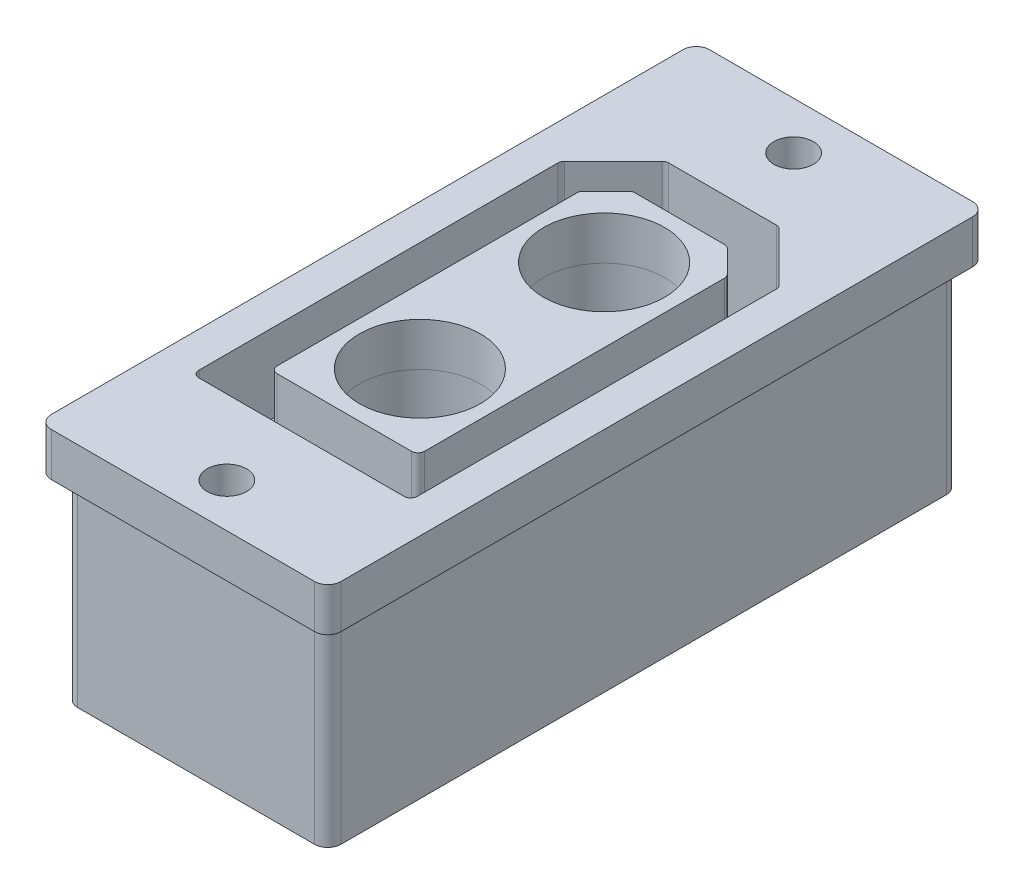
ISO-10303-21;
HEADER;
FILE_DESCRIPTION(('STEP AP214'),'2;1');
FILE_NAME('part.step','',(''),(''),'','','');
FILE_SCHEMA(('AUTOMOTIVE_DESIGN { 1 0 10303 214 1 1 1 1 }'));
ENDSEC;
DATA;
#1=APPLICATION_CONTEXT('core data for automotive mechanical design processes');
#2=APPLICATION_PROTOCOL_DEFINITION('international standard','automotive_design',2000,#1);
#3=PRODUCT_CONTEXT('',#1,'mechanical');
#4=PRODUCT('Part','Part','',(#3));
#5=PRODUCT_RELATED_PRODUCT_CATEGORY('part','',(#4));
#6=PRODUCT_DEFINITION_FORMATION('','',#4);
#7=PRODUCT_DEFINITION_CONTEXT('part definition',#1,'design');
#8=PRODUCT_DEFINITION('design','',#6,#7);
#9=PRODUCT_DEFINITION_SHAPE('','',#8);
#10=(LENGTH_UNIT() NAMED_UNIT(*) SI_UNIT(.MILLI.,.METRE.));
#11=(NAMED_UNIT(*) PLANE_ANGLE_UNIT() SI_UNIT($,.RADIAN.));
#12=(NAMED_UNIT(*) SI_UNIT($,.STERADIAN.) SOLID_ANGLE_UNIT());
#13=UNCERTAINTY_MEASURE_WITH_UNIT(LENGTH_MEASURE(1.E-05),#10,'distance_accuracy_value','');
#14=(GEOMETRIC_REPRESENTATION_CONTEXT(3) GLOBAL_UNCERTAINTY_ASSIGNED_CONTEXT((#13)) GLOBAL_UNIT_ASSIGNED_CONTEXT((#10,
#11,#12)) REPRESENTATION_CONTEXT('',''));
#15=CARTESIAN_POINT('',(0.,0.,0.));
#16=DIRECTION('',(0.,0.,1.));
#17=DIRECTION('',(1.,0.,0.));
#18=AXIS2_PLACEMENT_3D('',#15,#16,#17);
#19=CARTESIAN_POINT('',(0.,-15.,-37.75));
#20=DIRECTION('',(0.,0.,-1.));
#21=DIRECTION('',(-1.,0.,0.));
#22=AXIS2_PLACEMENT_3D('',#19,#20,#21);
#23=PLANE('',#22);
#24=DIRECTION('',(-1.,0.,0.));
#25=VECTOR('',#24,1.);
#26=CARTESIAN_POINT('',(0.,0.,-37.75));
#27=LINE('',#26,#25);
#28=CARTESIAN_POINT('',(14.61,0.,-37.75));
#29=VERTEX_POINT('',#28);
#30=CARTESIAN_POINT('',(7.39000000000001,0.,-37.75));
#31=VERTEX_POINT('',#30);
#32=EDGE_CURVE('E216',#29,#31,#27,.T.);
#33=ORIENTED_EDGE('',*,*,#32,.F.);
#34=DIRECTION('',(0.,-1.,0.));
#35=VECTOR('',#34,1.);
#36=CARTESIAN_POINT('',(14.61,-15.,-37.75));
#37=LINE('',#36,#35);
#38=CARTESIAN_POINT('',(14.61,-15.,-37.75));
#39=VERTEX_POINT('',#38);
#40=EDGE_CURVE('E202',#29,#39,#37,.T.);
#41=ORIENTED_EDGE('',*,*,#40,.T.);
#42=DIRECTION('',(-1.,0.,0.));
#43=VECTOR('',#42,1.);
#44=CARTESIAN_POINT('',(0.,-15.,-37.75));
#45=LINE('',#44,#43);
#46=CARTESIAN_POINT('',(7.39000000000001,-15.,-37.75));
#47=VERTEX_POINT('',#46);
#48=EDGE_CURVE('E173',#39,#47,#45,.T.);
#49=ORIENTED_EDGE('',*,*,#48,.T.);
#50=DIRECTION('',(0.,1.,0.));
#51=VECTOR('',#50,1.);
#52=CARTESIAN_POINT('',(7.39000000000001,-15.,-37.75));
#53=LINE('',#52,#51);
#54=EDGE_CURVE('E199',#47,#31,#53,.T.);
#55=ORIENTED_EDGE('',*,*,#54,.T.);
#56=EDGE_LOOP('',(#33,#41,#49,#55));
#57=FACE_BOUND('',#56,.T.);
#58=ADVANCED_FACE('F114',(#57),#23,.T.);
#59=CARTESIAN_POINT('',(16.61,-15.,0.));
#60=DIRECTION('',(-1.,0.,0.));
#61=DIRECTION('',(0.,0.,1.));
#62=AXIS2_PLACEMENT_3D('',#59,#60,#61);
#63=PLANE('',#62);
#64=DIRECTION('',(0.,0.,1.));
#65=VECTOR('',#64,1.);
#66=CARTESIAN_POINT('',(16.61,-15.,0.));
#67=LINE('',#66,#65);
#68=CARTESIAN_POINT('',(16.61,-15.,-35.75));
#69=VERTEX_POINT('',#68);
#70=CARTESIAN_POINT('',(16.61,-15.,-12.25));
#71=VERTEX_POINT('',#70);
#72=EDGE_CURVE('E178',#69,#71,#67,.T.);
#73=ORIENTED_EDGE('',*,*,#72,.F.);
#74=DIRECTION('',(0.,1.,0.));
#75=VECTOR('',#74,1.);
#76=CARTESIAN_POINT('',(16.61,0.,-35.75));
#77=LINE('',#76,#75);
#78=CARTESIAN_POINT('',(16.61,0.,-35.75));
#79=VERTEX_POINT('',#78);
#80=EDGE_CURVE('E188',#69,#79,#77,.T.);
#81=ORIENTED_EDGE('',*,*,#80,.T.);
#82=DIRECTION('',(0.,0.,1.));
#83=VECTOR('',#82,1.);
#84=CARTESIAN_POINT('',(16.61,0.,0.));
#85=LINE('',#84,#83);
#86=CARTESIAN_POINT('',(16.61,0.,-12.25));
#87=VERTEX_POINT('',#86);
#88=EDGE_CURVE('E217',#79,#87,#85,.T.);
#89=ORIENTED_EDGE('',*,*,#88,.T.);
#90=DIRECTION('',(0.,1.,0.));
#91=VECTOR('',#90,1.);
#92=CARTESIAN_POINT('',(16.61,-15.,-12.25));
#93=LINE('',#92,#91);
#94=EDGE_CURVE('E186',#71,#87,#93,.T.);
#95=ORIENTED_EDGE('',*,*,#94,.F.);
#96=EDGE_LOOP('',(#73,#81,#89,#95));
#97=FACE_BOUND('',#96,.T.);
#98=ADVANCED_FACE('F209',(#97),#63,.F.);
#99=CARTESIAN_POINT('',(0.,-15.,-12.25));
#100=DIRECTION('',(0.,0.,-1.));
#101=DIRECTION('',(-1.,0.,0.));
#102=AXIS2_PLACEMENT_3D('',#99,#100,#101);
#103=PLANE('',#102);
#104=DIRECTION('',(-1.,0.,0.));
#105=VECTOR('',#104,1.);
#106=CARTESIAN_POINT('',(0.,0.,-12.25));
#107=LINE('',#106,#105);
#108=CARTESIAN_POINT('',(5.39000000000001,0.,-12.25));
#109=VERTEX_POINT('',#108);
#110=EDGE_CURVE('E185',#87,#109,#107,.T.);
#111=ORIENTED_EDGE('',*,*,#110,.T.);
#112=DIRECTION('',(0.,1.,0.));
#113=VECTOR('',#112,1.);
#114=CARTESIAN_POINT('',(5.39000000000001,-15.,-12.25));
#115=LINE('',#114,#113);
#116=CARTESIAN_POINT('',(5.39000000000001,-15.,-12.25));
#117=VERTEX_POINT('',#116);
#118=EDGE_CURVE('E170',#117,#109,#115,.T.);
#119=ORIENTED_EDGE('',*,*,#118,.F.);
#120=DIRECTION('',(-1.,0.,0.));
#121=VECTOR('',#120,1.);
#122=CARTESIAN_POINT('',(0.,-15.,-12.25));
#123=LINE('',#122,#121);
#124=EDGE_CURVE('E172',#71,#117,#123,.T.);
#125=ORIENTED_EDGE('',*,*,#124,.F.);
#126=ORIENTED_EDGE('',*,*,#94,.T.);
#127=EDGE_LOOP('',(#111,#119,#125,#126));
#128=FACE_BOUND('',#127,.T.);
#129=ADVANCED_FACE('F183',(#128),#103,.F.);
#130=CARTESIAN_POINT('',(11.,-15.,-32.));
#131=DIRECTION('',(0.,1.,0.));
#132=DIRECTION('',(0.,0.,1.));
#133=AXIS2_PLACEMENT_3D('',#130,#131,#132);
#134=CYLINDRICAL_SURFACE('',#133,4.59999999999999);
#135=CARTESIAN_POINT('',(11.,-15.,-32.));
#136=DIRECTION('',(0.,1.,0.));
#137=DIRECTION('',(0.,0.,1.));
#138=AXIS2_PLACEMENT_3D('',#135,#136,#137);
#139=CIRCLE('',#138,4.59999999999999);
#140=CARTESIAN_POINT('',(11.,-15.,-27.4));
#141=VERTEX_POINT('',#140);
#142=EDGE_CURVE('E231',#141,#141,#139,.T.);
#143=ORIENTED_EDGE('',*,*,#142,.F.);
#144=EDGE_LOOP('',(#143));
#145=FACE_BOUND('',#144,.T.);
#146=CARTESIAN_POINT('',(11.,0.,-32.));
#147=DIRECTION('',(0.,1.,0.));
#148=DIRECTION('',(0.,0.,1.));
#149=AXIS2_PLACEMENT_3D('',#146,#147,#148);
#150=CIRCLE('',#149,4.59999999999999);
#151=CARTESIAN_POINT('',(11.,0.,-27.4));
#152=VERTEX_POINT('',#151);
#153=EDGE_CURVE('E221',#152,#152,#150,.T.);
#154=ORIENTED_EDGE('',*,*,#153,.T.);
#155=EDGE_LOOP('',(#154));
#156=FACE_BOUND('',#155,.T.);
#157=ADVANCED_FACE('F248',(#145,#156),#134,.F.);
#158=CARTESIAN_POINT('',(11.,-15.,-18.));
#159=DIRECTION('',(0.,1.,0.));
#160=DIRECTION('',(0.,0.,1.));
#161=AXIS2_PLACEMENT_3D('',#158,#159,#160);
#162=CYLINDRICAL_SURFACE('',#161,4.6);
#163=CARTESIAN_POINT('',(11.,-15.,-18.));
#164=DIRECTION('',(0.,1.,0.));
#165=DIRECTION('',(0.,0.,1.));
#166=AXIS2_PLACEMENT_3D('',#163,#164,#165);
#167=CIRCLE('',#166,4.6);
#168=CARTESIAN_POINT('',(11.,-15.,-13.4));
#169=VERTEX_POINT('',#168);
#170=EDGE_CURVE('E229',#169,#169,#167,.T.);
#171=ORIENTED_EDGE('',*,*,#170,.F.);
#172=EDGE_LOOP('',(#171));
#173=FACE_BOUND('',#172,.T.);
#174=CARTESIAN_POINT('',(11.,0.,-18.));
#175=DIRECTION('',(0.,1.,0.));
#176=DIRECTION('',(0.,0.,1.));
#177=AXIS2_PLACEMENT_3D('',#174,#175,#176);
#178=CIRCLE('',#177,4.6);
#179=CARTESIAN_POINT('',(11.,0.,-13.4));
#180=VERTEX_POINT('',#179);
#181=EDGE_CURVE('E225',#180,#180,#178,.T.);
#182=ORIENTED_EDGE('',*,*,#181,.T.);
#183=EDGE_LOOP('',(#182));
#184=FACE_BOUND('',#183,.T.);
#185=ADVANCED_FACE('F241',(#173,#184),#162,.F.);
#186=CARTESIAN_POINT('',(5.39000000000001,-15.,0.));
#187=DIRECTION('',(-1.,0.,0.));
#188=DIRECTION('',(0.,0.,1.));
#189=AXIS2_PLACEMENT_3D('',#186,#187,#188);
#190=PLANE('',#189);
#191=DIRECTION('',(0.,0.,1.));
#192=VECTOR('',#191,1.);
#193=CARTESIAN_POINT('',(5.39000000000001,0.,0.));
#194=LINE('',#193,#192);
#195=CARTESIAN_POINT('',(5.39000000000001,0.,-35.75));
#196=VERTEX_POINT('',#195);
#197=EDGE_CURVE('E220',#196,#109,#194,.T.);
#198=ORIENTED_EDGE('',*,*,#197,.F.);
#199=DIRECTION('',(0.,-1.,0.));
#200=VECTOR('',#199,1.);
#201=CARTESIAN_POINT('',(5.39000000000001,-15.,-35.75));
#202=LINE('',#201,#200);
#203=CARTESIAN_POINT('',(5.39000000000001,-15.,-35.75));
#204=VERTEX_POINT('',#203);
#205=EDGE_CURVE('E13',#196,#204,#202,.T.);
#206=ORIENTED_EDGE('',*,*,#205,.T.);
#207=DIRECTION('',(0.,0.,1.));
#208=VECTOR('',#207,1.);
#209=CARTESIAN_POINT('',(5.39000000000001,-15.,0.));
#210=LINE('',#209,#208);
#211=EDGE_CURVE('E166',#204,#117,#210,.T.);
#212=ORIENTED_EDGE('',*,*,#211,.T.);
#213=ORIENTED_EDGE('',*,*,#118,.T.);
#214=EDGE_LOOP('',(#198,#206,#212,#213));
#215=FACE_BOUND('',#214,.T.);
#216=ADVANCED_FACE('F168',(#215),#190,.T.);
#217=CARTESIAN_POINT('',(0.,-15.,0.));
#218=DIRECTION('',(0.,1.,0.));
#219=DIRECTION('',(0.,0.,1.));
#220=AXIS2_PLACEMENT_3D('',#217,#218,#219);
#221=PLANE('',#220);
#222=ORIENTED_EDGE('',*,*,#170,.T.);
#223=EDGE_LOOP('',(#222));
#224=FACE_BOUND('',#223,.T.);
#225=ORIENTED_EDGE('',*,*,#142,.T.);
#226=EDGE_LOOP('',(#225));
#227=FACE_BOUND('',#226,.T.);
#228=ORIENTED_EDGE('',*,*,#48,.F.);
#229=DIRECTION('',(0.707106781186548,0.,0.707106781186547));
#230=VECTOR('',#229,1.);
#231=CARTESIAN_POINT('',(16.61,-15.,-35.75));
#232=LINE('',#231,#230);
#233=EDGE_CURVE('E123',#39,#69,#232,.T.);
#234=ORIENTED_EDGE('',*,*,#233,.T.);
#235=ORIENTED_EDGE('',*,*,#72,.T.);
#236=ORIENTED_EDGE('',*,*,#124,.T.);
#237=ORIENTED_EDGE('',*,*,#211,.F.);
#238=DIRECTION('',(-0.707106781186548,0.,0.707106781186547));
#239=VECTOR('',#238,1.);
#240=CARTESIAN_POINT('',(7.39000000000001,-15.,-37.75));
#241=LINE('',#240,#239);
#242=EDGE_CURVE('E135',#204,#47,#241,.F.);
#243=ORIENTED_EDGE('',*,*,#242,.T.);
#244=EDGE_LOOP('',(#228,#234,#235,#236,#237,#243));
#245=FACE_BOUND('',#244,.T.);
#246=ADVANCED_FACE('F176',(#224,#227,#245),#221,.F.);
#247=CARTESIAN_POINT('',(0.,0.,0.));
#248=DIRECTION('',(0.,1.,0.));
#249=DIRECTION('',(0.,0.,1.));
#250=AXIS2_PLACEMENT_3D('',#247,#248,#249);
#251=PLANE('',#250);
#252=ORIENTED_EDGE('',*,*,#181,.F.);
#253=EDGE_LOOP('',(#252));
#254=FACE_BOUND('',#253,.T.);
#255=ORIENTED_EDGE('',*,*,#153,.F.);
#256=EDGE_LOOP('',(#255));
#257=FACE_BOUND('',#256,.T.);
#258=ORIENTED_EDGE('',*,*,#88,.F.);
#259=DIRECTION('',(-0.707106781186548,0.,-0.707106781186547));
#260=VECTOR('',#259,1.);
#261=CARTESIAN_POINT('',(26.18,0.,-26.18));
#262=LINE('',#261,#260);
#263=EDGE_CURVE('E197',#79,#29,#262,.T.);
#264=ORIENTED_EDGE('',*,*,#263,.T.);
#265=ORIENTED_EDGE('',*,*,#32,.T.);
#266=DIRECTION('',(0.707106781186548,0.,-0.707106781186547));
#267=VECTOR('',#266,1.);
#268=CARTESIAN_POINT('',(-15.18,0.,-15.18));
#269=LINE('',#268,#267);
#270=EDGE_CURVE('E195',#31,#196,#269,.F.);
#271=ORIENTED_EDGE('',*,*,#270,.T.);
#272=ORIENTED_EDGE('',*,*,#197,.T.);
#273=ORIENTED_EDGE('',*,*,#110,.F.);
#274=EDGE_LOOP('',(#258,#264,#265,#271,#272,#273));
#275=FACE_BOUND('',#274,.T.);
#276=ADVANCED_FACE('F215',(#254,#257,#275),#251,.T.);
#277=CARTESIAN_POINT('',(16.61,-15.,-35.75));
#278=DIRECTION('',(0.707106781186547,0.,-0.707106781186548));
#279=DIRECTION('',(0.,-1.,0.));
#280=AXIS2_PLACEMENT_3D('',#277,#278,#279);
#281=PLANE('',#280);
#282=ORIENTED_EDGE('',*,*,#233,.F.);
#283=ORIENTED_EDGE('',*,*,#40,.F.);
#284=ORIENTED_EDGE('',*,*,#263,.F.);
#285=ORIENTED_EDGE('',*,*,#80,.F.);
#286=EDGE_LOOP('',(#282,#283,#284,#285));
#287=FACE_BOUND('',#286,.T.);
#288=ADVANCED_FACE('F211',(#287),#281,.T.);
#289=CARTESIAN_POINT('',(7.39000000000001,-15.,-37.75));
#290=DIRECTION('',(0.707106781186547,0.,0.707106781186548));
#291=DIRECTION('',(0.,1.,0.));
#292=AXIS2_PLACEMENT_3D('',#289,#290,#291);
#293=PLANE('',#292);
#294=ORIENTED_EDGE('',*,*,#242,.F.);
#295=ORIENTED_EDGE('',*,*,#205,.F.);
#296=ORIENTED_EDGE('',*,*,#270,.F.);
#297=ORIENTED_EDGE('',*,*,#54,.F.);
#298=EDGE_LOOP('',(#294,#295,#296,#297));
#299=FACE_BOUND('',#298,.T.);
#300=ADVANCED_FACE('F117',(#299),#293,.F.);
#301=CLOSED_SHELL('',(#58,#98,#129,#157,#185,#216,#246,#276,#288,#300));
#302=MANIFOLD_SOLID_BREP('B2',#301);
#303=CARTESIAN_POINT('',(0.,0.,0.));
#304=DIRECTION('',(0.,1.,0.));
#305=DIRECTION('',(0.,0.,1.));
#306=AXIS2_PLACEMENT_3D('',#303,#304,#305);
#307=PLANE('',#306);
#308=DIRECTION('',(1.,0.,0.));
#309=VECTOR('',#308,1.);
#310=CARTESIAN_POINT('',(0.,0.,-50.));
#311=LINE('',#310,#309);
#312=CARTESIAN_POINT('',(0.999999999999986,0.,-50.));
#313=VERTEX_POINT('',#312);
#314=CARTESIAN_POINT('',(21.,0.,-50.));
#315=VERTEX_POINT('',#314);
#316=EDGE_CURVE('E690',#313,#315,#311,.T.);
#317=ORIENTED_EDGE('',*,*,#316,.T.);
#318=CARTESIAN_POINT('',(21.,0.,-49.));
#319=DIRECTION('',(0.,1.,0.));
#320=DIRECTION('',(0.,0.,1.));
#321=AXIS2_PLACEMENT_3D('',#318,#319,#320);
#322=CIRCLE('',#321,1.);
#323=CARTESIAN_POINT('',(22.,0.,-49.));
#324=VERTEX_POINT('',#323);
#325=EDGE_CURVE('E835',#315,#324,#322,.F.);
#326=ORIENTED_EDGE('',*,*,#325,.T.);
#327=DIRECTION('',(0.,0.,-1.));
#328=VECTOR('',#327,1.);
#329=CARTESIAN_POINT('',(22.,0.,0.));
#330=LINE('',#329,#328);
#331=CARTESIAN_POINT('',(22.,0.,-1.));
#332=VERTEX_POINT('',#331);
#333=EDGE_CURVE('E630',#332,#324,#330,.T.);
#334=ORIENTED_EDGE('',*,*,#333,.F.);
#335=CARTESIAN_POINT('',(21.,0.,-1.));
#336=DIRECTION('',(0.,1.,0.));
#337=DIRECTION('',(0.,0.,1.));
#338=AXIS2_PLACEMENT_3D('',#335,#336,#337);
#339=CIRCLE('',#338,1.);
#340=CARTESIAN_POINT('',(21.,0.,0.));
#341=VERTEX_POINT('',#340);
#342=EDGE_CURVE('E826',#332,#341,#339,.F.);
#343=ORIENTED_EDGE('',*,*,#342,.T.);
#344=DIRECTION('',(1.,0.,0.));
#345=VECTOR('',#344,1.);
#346=CARTESIAN_POINT('',(0.,0.,0.));
#347=LINE('',#346,#345);
#348=CARTESIAN_POINT('',(1.,0.,0.));
#349=VERTEX_POINT('',#348);
#350=EDGE_CURVE('E653',#349,#341,#347,.T.);
#351=ORIENTED_EDGE('',*,*,#350,.F.);
#352=CARTESIAN_POINT('',(1.,0.,-1.));
#353=DIRECTION('',(0.,1.,0.));
#354=DIRECTION('',(0.,0.,1.));
#355=AXIS2_PLACEMENT_3D('',#352,#353,#354);
#356=CIRCLE('',#355,1.);
#357=CARTESIAN_POINT('',(0.,0.,-1.));
#358=VERTEX_POINT('',#357);
#359=EDGE_CURVE('E829',#349,#358,#356,.F.);
#360=ORIENTED_EDGE('',*,*,#359,.T.);
#361=DIRECTION('',(0.,0.,-1.));
#362=VECTOR('',#361,1.);
#363=CARTESIAN_POINT('',(0.,0.,0.));
#364=LINE('',#363,#362);
#365=CARTESIAN_POINT('',(0.,0.,-49.));
#366=VERTEX_POINT('',#365);
#367=EDGE_CURVE('E694',#358,#366,#364,.T.);
#368=ORIENTED_EDGE('',*,*,#367,.T.);
#369=CARTESIAN_POINT('',(0.999999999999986,0.,-49.));
#370=DIRECTION('',(0.,1.,0.));
#371=DIRECTION('',(0.,0.,1.));
#372=AXIS2_PLACEMENT_3D('',#369,#370,#371);
#373=CIRCLE('',#372,1.);
#374=EDGE_CURVE('E832',#366,#313,#373,.F.);
#375=ORIENTED_EDGE('',*,*,#374,.T.);
#376=EDGE_LOOP('',(#317,#326,#334,#343,#351,#360,#368,#375));
#377=FACE_BOUND('',#376,.T.);
#378=DIRECTION('',(0.,0.,-1.));
#379=VECTOR('',#378,1.);
#380=CARTESIAN_POINT('',(1.,0.,0.));
#381=LINE('',#380,#379);
#382=CARTESIAN_POINT('',(1.,0.,-2.));
#383=VERTEX_POINT('',#382);
#384=CARTESIAN_POINT('',(1.,0.,-48.));
#385=VERTEX_POINT('',#384);
#386=EDGE_CURVE('E631',#383,#385,#381,.T.);
#387=ORIENTED_EDGE('',*,*,#386,.F.);
#388=CARTESIAN_POINT('',(2.,0.,-2.));
#389=DIRECTION('',(0.,1.,0.));
#390=DIRECTION('',(0.,0.,1.));
#391=AXIS2_PLACEMENT_3D('',#388,#389,#390);
#392=CIRCLE('',#391,1.);
#393=CARTESIAN_POINT('',(2.,0.,-1.));
#394=VERTEX_POINT('',#393);
#395=EDGE_CURVE('E869',#383,#394,#392,.T.);
#396=ORIENTED_EDGE('',*,*,#395,.T.);
#397=DIRECTION('',(1.,0.,0.));
#398=VECTOR('',#397,1.);
#399=CARTESIAN_POINT('',(0.,0.,-1.));
#400=LINE('',#399,#398);
#401=CARTESIAN_POINT('',(20.,0.,-1.));
#402=VERTEX_POINT('',#401);
#403=EDGE_CURVE('E635',#394,#402,#400,.T.);
#404=ORIENTED_EDGE('',*,*,#403,.T.);
#405=CARTESIAN_POINT('',(20.,0.,-2.));
#406=DIRECTION('',(0.,1.,0.));
#407=DIRECTION('',(0.,0.,1.));
#408=AXIS2_PLACEMENT_3D('',#405,#406,#407);
#409=CIRCLE('',#408,1.);
#410=CARTESIAN_POINT('',(21.,0.,-2.));
#411=VERTEX_POINT('',#410);
#412=EDGE_CURVE('E872',#402,#411,#409,.T.);
#413=ORIENTED_EDGE('',*,*,#412,.T.);
#414=DIRECTION('',(0.,0.,-1.));
#415=VECTOR('',#414,1.);
#416=CARTESIAN_POINT('',(21.,0.,0.));
#417=LINE('',#416,#415);
#418=CARTESIAN_POINT('',(21.,0.,-48.));
#419=VERTEX_POINT('',#418);
#420=EDGE_CURVE('E639',#411,#419,#417,.T.);
#421=ORIENTED_EDGE('',*,*,#420,.T.);
#422=CARTESIAN_POINT('',(20.,0.,-48.));
#423=DIRECTION('',(0.,1.,0.));
#424=DIRECTION('',(0.,0.,1.));
#425=AXIS2_PLACEMENT_3D('',#422,#423,#424);
#426=CIRCLE('',#425,1.);
#427=CARTESIAN_POINT('',(20.,0.,-49.));
#428=VERTEX_POINT('',#427);
#429=EDGE_CURVE('E112',#419,#428,#426,.T.);
#430=ORIENTED_EDGE('',*,*,#429,.T.);
#431=DIRECTION('',(1.,0.,0.));
#432=VECTOR('',#431,1.);
#433=CARTESIAN_POINT('',(0.,0.,-49.));
#434=LINE('',#433,#432);
#435=CARTESIAN_POINT('',(2.,0.,-49.));
#436=VERTEX_POINT('',#435);
#437=EDGE_CURVE('E643',#436,#428,#434,.T.);
#438=ORIENTED_EDGE('',*,*,#437,.F.);
#439=CARTESIAN_POINT('',(2.,0.,-48.));
#440=DIRECTION('',(0.,1.,0.));
#441=DIRECTION('',(0.,0.,1.));
#442=AXIS2_PLACEMENT_3D('',#439,#440,#441);
#443=CIRCLE('',#442,1.);
#444=EDGE_CURVE('E389',#436,#385,#443,.T.);
#445=ORIENTED_EDGE('',*,*,#444,.T.);
#446=EDGE_LOOP('',(#387,#396,#404,#413,#421,#430,#438,#445));
#447=FACE_BOUND('',#446,.T.);
#448=ADVANCED_FACE('F380',(#377,#447),#307,.F.);
#449=CARTESIAN_POINT('',(22.,3.3,0.));
#450=DIRECTION('',(-1.,0.,0.));
#451=DIRECTION('',(0.,0.,1.));
#452=AXIS2_PLACEMENT_3D('',#449,#450,#451);
#453=PLANE('',#452);
#454=ORIENTED_EDGE('',*,*,#333,.T.);
#455=DIRECTION('',(0.,-1.,0.));
#456=VECTOR('',#455,1.);
#457=CARTESIAN_POINT('',(22.,3.3,-49.));
#458=LINE('',#457,#456);
#459=CARTESIAN_POINT('',(22.,3.3,-49.));
#460=VERTEX_POINT('',#459);
#461=EDGE_CURVE('E842',#324,#460,#458,.F.);
#462=ORIENTED_EDGE('',*,*,#461,.T.);
#463=DIRECTION('',(0.,0.,-1.));
#464=VECTOR('',#463,1.);
#465=CARTESIAN_POINT('',(22.,3.3,0.));
#466=LINE('',#465,#464);
#467=CARTESIAN_POINT('',(22.,3.3,-1.));
#468=VERTEX_POINT('',#467);
#469=EDGE_CURVE('E671',#468,#460,#466,.T.);
#470=ORIENTED_EDGE('',*,*,#469,.F.);
#471=DIRECTION('',(0.,-1.,0.));
#472=VECTOR('',#471,1.);
#473=CARTESIAN_POINT('',(22.,3.3,-1.));
#474=LINE('',#473,#472);
#475=EDGE_CURVE('E838',#468,#332,#474,.T.);
#476=ORIENTED_EDGE('',*,*,#475,.T.);
#477=EDGE_LOOP('',(#454,#462,#470,#476));
#478=FACE_BOUND('',#477,.T.);
#479=ADVANCED_FACE('F926',(#478),#453,.F.);
#480=CARTESIAN_POINT('',(0.,3.3,-50.));
#481=DIRECTION('',(0.,0.,-1.));
#482=DIRECTION('',(-1.,0.,0.));
#483=AXIS2_PLACEMENT_3D('',#480,#481,#482);
#484=PLANE('',#483);
#485=DIRECTION('',(1.,0.,0.));
#486=VECTOR('',#485,1.);
#487=CARTESIAN_POINT('',(0.,3.3,-50.));
#488=LINE('',#487,#486);
#489=CARTESIAN_POINT('',(0.999999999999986,3.3,-50.));
#490=VERTEX_POINT('',#489);
#491=CARTESIAN_POINT('',(21.,3.3,-50.));
#492=VERTEX_POINT('',#491);
#493=EDGE_CURVE('E675',#490,#492,#488,.T.);
#494=ORIENTED_EDGE('',*,*,#493,.T.);
#495=DIRECTION('',(0.,-1.,0.));
#496=VECTOR('',#495,1.);
#497=CARTESIAN_POINT('',(21.,0.,-50.));
#498=LINE('',#497,#496);
#499=EDGE_CURVE('E822',#492,#315,#498,.T.);
#500=ORIENTED_EDGE('',*,*,#499,.T.);
#501=ORIENTED_EDGE('',*,*,#316,.F.);
#502=DIRECTION('',(0.,-1.,0.));
#503=VECTOR('',#502,1.);
#504=CARTESIAN_POINT('',(0.999999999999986,3.3,-50.));
#505=LINE('',#504,#503);
#506=EDGE_CURVE('E819',#313,#490,#505,.F.);
#507=ORIENTED_EDGE('',*,*,#506,.T.);
#508=EDGE_LOOP('',(#494,#500,#501,#507));
#509=FACE_BOUND('',#508,.T.);
#510=ADVANCED_FACE('F932',(#509),#484,.T.);
#511=CARTESIAN_POINT('',(0.,3.3,0.));
#512=DIRECTION('',(-1.,0.,0.));
#513=DIRECTION('',(0.,0.,1.));
#514=AXIS2_PLACEMENT_3D('',#511,#512,#513);
#515=PLANE('',#514);
#516=DIRECTION('',(0.,0.,-1.));
#517=VECTOR('',#516,1.);
#518=CARTESIAN_POINT('',(0.,3.3,0.));
#519=LINE('',#518,#517);
#520=CARTESIAN_POINT('',(0.,3.3,-1.));
#521=VERTEX_POINT('',#520);
#522=CARTESIAN_POINT('',(0.,3.3,-49.));
#523=VERTEX_POINT('',#522);
#524=EDGE_CURVE('E679',#521,#523,#519,.T.);
#525=ORIENTED_EDGE('',*,*,#524,.T.);
#526=DIRECTION('',(0.,-1.,0.));
#527=VECTOR('',#526,1.);
#528=CARTESIAN_POINT('',(0.,3.3,-49.));
#529=LINE('',#528,#527);
#530=EDGE_CURVE('E859',#523,#366,#529,.T.);
#531=ORIENTED_EDGE('',*,*,#530,.T.);
#532=ORIENTED_EDGE('',*,*,#367,.F.);
#533=DIRECTION('',(0.,-1.,0.));
#534=VECTOR('',#533,1.);
#535=CARTESIAN_POINT('',(0.,3.3,-1.));
#536=LINE('',#535,#534);
#537=EDGE_CURVE('E856',#358,#521,#536,.F.);
#538=ORIENTED_EDGE('',*,*,#537,.T.);
#539=EDGE_LOOP('',(#525,#531,#532,#538));
#540=FACE_BOUND('',#539,.T.);
#541=ADVANCED_FACE('F942',(#540),#515,.T.);
#542=CARTESIAN_POINT('',(2.70000000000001,3.3,0.));
#543=DIRECTION('',(1.,0.,0.));
#544=DIRECTION('',(0.,0.,-1.));
#545=AXIS2_PLACEMENT_3D('',#542,#543,#544);
#546=PLANE('',#545);
#547=DIRECTION('',(0.,0.,1.));
#548=VECTOR('',#547,1.);
#549=CARTESIAN_POINT('',(2.70000000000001,3.3,0.));
#550=LINE('',#549,#548);
#551=CARTESIAN_POINT('',(2.7,3.3,-36.7928932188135));
#552=VERTEX_POINT('',#551);
#553=CARTESIAN_POINT('',(2.70000000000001,3.3,-9.5));
#554=VERTEX_POINT('',#553);
#555=EDGE_CURVE('E648',#552,#554,#550,.T.);
#556=ORIENTED_EDGE('',*,*,#555,.T.);
#557=DIRECTION('',(0.,-1.,0.));
#558=VECTOR('',#557,1.);
#559=CARTESIAN_POINT('',(2.70000000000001,3.3,-9.5));
#560=LINE('',#559,#558);
#561=CARTESIAN_POINT('',(2.70000000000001,-15.,-9.5));
#562=VERTEX_POINT('',#561);
#563=EDGE_CURVE('E725',#554,#562,#560,.T.);
#564=ORIENTED_EDGE('',*,*,#563,.T.);
#565=DIRECTION('',(0.,0.,1.));
#566=VECTOR('',#565,1.);
#567=CARTESIAN_POINT('',(2.70000000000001,-15.,0.));
#568=LINE('',#567,#566);
#569=CARTESIAN_POINT('',(2.7,-15.,-36.7928932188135));
#570=VERTEX_POINT('',#569);
#571=EDGE_CURVE('E647',#570,#562,#568,.T.);
#572=ORIENTED_EDGE('',*,*,#571,.F.);
#573=DIRECTION('',(0.,-1.,0.));
#574=VECTOR('',#573,1.);
#575=CARTESIAN_POINT('',(2.7,3.3,-36.7928932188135));
#576=LINE('',#575,#574);
#577=EDGE_CURVE('E721',#570,#552,#576,.F.);
#578=ORIENTED_EDGE('',*,*,#577,.T.);
#579=EDGE_LOOP('',(#556,#564,#572,#578));
#580=FACE_BOUND('',#579,.T.);
#581=ADVANCED_FACE('F945',(#580),#546,.T.);
#582=CARTESIAN_POINT('',(0.,3.3,-41.));
#583=DIRECTION('',(0.,0.,1.));
#584=DIRECTION('',(1.,0.,0.));
#585=AXIS2_PLACEMENT_3D('',#582,#583,#584);
#586=PLANE('',#585);
#587=DIRECTION('',(-1.,0.,0.));
#588=VECTOR('',#587,1.);
#589=CARTESIAN_POINT('',(0.,-15.,-41.));
#590=LINE('',#589,#588);
#591=CARTESIAN_POINT('',(15.0928932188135,-15.,-41.));
#592=VERTEX_POINT('',#591);
#593=CARTESIAN_POINT('',(6.90710678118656,-15.,-41.));
#594=VERTEX_POINT('',#593);
#595=EDGE_CURVE('E607',#592,#594,#590,.T.);
#596=ORIENTED_EDGE('',*,*,#595,.F.);
#597=DIRECTION('',(0.,1.,0.));
#598=VECTOR('',#597,1.);
#599=CARTESIAN_POINT('',(15.0928932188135,3.3,-41.));
#600=LINE('',#599,#598);
#601=CARTESIAN_POINT('',(15.0928932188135,3.3,-41.));
#602=VERTEX_POINT('',#601);
#603=EDGE_CURVE('E739',#592,#602,#600,.T.);
#604=ORIENTED_EDGE('',*,*,#603,.T.);
#605=DIRECTION('',(-1.,0.,0.));
#606=VECTOR('',#605,1.);
#607=CARTESIAN_POINT('',(0.,3.3,-41.));
#608=LINE('',#607,#606);
#609=CARTESIAN_POINT('',(6.90710678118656,3.3,-41.));
#610=VERTEX_POINT('',#609);
#611=EDGE_CURVE('E652',#602,#610,#608,.T.);
#612=ORIENTED_EDGE('',*,*,#611,.T.);
#613=DIRECTION('',(0.,1.,0.));
#614=VECTOR('',#613,1.);
#615=CARTESIAN_POINT('',(6.90710678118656,3.3,-41.));
#616=LINE('',#615,#614);
#617=EDGE_CURVE('E735',#610,#594,#616,.F.);
#618=ORIENTED_EDGE('',*,*,#617,.T.);
#619=EDGE_LOOP('',(#596,#604,#612,#618));
#620=FACE_BOUND('',#619,.T.);
#621=ADVANCED_FACE('F963',(#620),#586,.T.);
#622=CARTESIAN_POINT('',(19.3,3.3,0.));
#623=DIRECTION('',(1.,0.,0.));
#624=DIRECTION('',(0.,0.,-1.));
#625=AXIS2_PLACEMENT_3D('',#622,#623,#624);
#626=PLANE('',#625);
#627=DIRECTION('',(0.,0.,1.));
#628=VECTOR('',#627,1.);
#629=CARTESIAN_POINT('',(19.3,-15.,0.));
#630=LINE('',#629,#628);
#631=CARTESIAN_POINT('',(19.3,-15.,-36.7928932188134));
#632=VERTEX_POINT('',#631);
#633=CARTESIAN_POINT('',(19.3,-15.,-9.5));
#634=VERTEX_POINT('',#633);
#635=EDGE_CURVE('E600',#632,#634,#630,.T.);
#636=ORIENTED_EDGE('',*,*,#635,.T.);
#637=DIRECTION('',(0.,-1.,0.));
#638=VECTOR('',#637,1.);
#639=CARTESIAN_POINT('',(19.3,3.3,-9.5));
#640=LINE('',#639,#638);
#641=CARTESIAN_POINT('',(19.3,3.3,-9.5));
#642=VERTEX_POINT('',#641);
#643=EDGE_CURVE('E572',#634,#642,#640,.F.);
#644=ORIENTED_EDGE('',*,*,#643,.T.);
#645=DIRECTION('',(0.,0.,1.));
#646=VECTOR('',#645,1.);
#647=CARTESIAN_POINT('',(19.3,3.3,0.));
#648=LINE('',#647,#646);
#649=CARTESIAN_POINT('',(19.3,3.3,-36.7928932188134));
#650=VERTEX_POINT('',#649);
#651=EDGE_CURVE('E657',#650,#642,#648,.T.);
#652=ORIENTED_EDGE('',*,*,#651,.F.);
#653=DIRECTION('',(0.,-1.,0.));
#654=VECTOR('',#653,1.);
#655=CARTESIAN_POINT('',(19.3,-15.,-36.7928932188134));
#656=LINE('',#655,#654);
#657=EDGE_CURVE('E590',#650,#632,#656,.T.);
#658=ORIENTED_EDGE('',*,*,#657,.T.);
#659=EDGE_LOOP('',(#636,#644,#652,#658));
#660=FACE_BOUND('',#659,.T.);
#661=ADVANCED_FACE('F954',(#660),#626,.F.);
#662=CARTESIAN_POINT('',(11.,3.3,-46.4));
#663=DIRECTION('',(0.,-1.,0.));
#664=DIRECTION('',(0.,0.,-1.));
#665=AXIS2_PLACEMENT_3D('',#662,#663,#664);
#666=CYLINDRICAL_SURFACE('',#665,1.5);
#667=CARTESIAN_POINT('',(11.,3.3,-46.4));
#668=DIRECTION('',(0.,1.,0.));
#669=DIRECTION('',(0.,0.,1.));
#670=AXIS2_PLACEMENT_3D('',#667,#668,#669);
#671=CIRCLE('',#670,1.5);
#672=CARTESIAN_POINT('',(11.,3.3,-44.9));
#673=VERTEX_POINT('',#672);
#674=EDGE_CURVE('E667',#673,#673,#671,.T.);
#675=ORIENTED_EDGE('',*,*,#674,.T.);
#676=EDGE_LOOP('',(#675));
#677=FACE_BOUND('',#676,.T.);
#678=CARTESIAN_POINT('',(11.,-15.,-46.4));
#679=DIRECTION('',(0.,1.,0.));
#680=DIRECTION('',(0.,0.,1.));
#681=AXIS2_PLACEMENT_3D('',#678,#679,#680);
#682=CIRCLE('',#681,1.5);
#683=CARTESIAN_POINT('',(11.,-15.,-44.9));
#684=VERTEX_POINT('',#683);
#685=EDGE_CURVE('E605',#684,#684,#682,.T.);
#686=ORIENTED_EDGE('',*,*,#685,.F.);
#687=EDGE_LOOP('',(#686));
#688=FACE_BOUND('',#687,.T.);
#689=ADVANCED_FACE('F950',(#677,#688),#666,.F.);
#690=CARTESIAN_POINT('',(11.,3.3,-3.33141687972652));
#691=DIRECTION('',(0.,-1.,0.));
#692=DIRECTION('',(0.,0.,-1.));
#693=AXIS2_PLACEMENT_3D('',#690,#691,#692);
#694=CYLINDRICAL_SURFACE('',#693,1.5);
#695=CARTESIAN_POINT('',(11.,3.3,-3.33141687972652));
#696=DIRECTION('',(0.,1.,0.));
#697=DIRECTION('',(0.,0.,1.));
#698=AXIS2_PLACEMENT_3D('',#695,#696,#697);
#699=CIRCLE('',#698,1.5);
#700=CARTESIAN_POINT('',(11.,3.3,-1.83141687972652));
#701=VERTEX_POINT('',#700);
#702=EDGE_CURVE('E663',#701,#701,#699,.T.);
#703=ORIENTED_EDGE('',*,*,#702,.T.);
#704=EDGE_LOOP('',(#703));
#705=FACE_BOUND('',#704,.T.);
#706=CARTESIAN_POINT('',(11.,-15.,-3.33141687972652));
#707=DIRECTION('',(0.,1.,0.));
#708=DIRECTION('',(0.,0.,1.));
#709=AXIS2_PLACEMENT_3D('',#706,#707,#708);
#710=CIRCLE('',#709,1.5);
#711=CARTESIAN_POINT('',(11.,-15.,-1.83141687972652));
#712=VERTEX_POINT('',#711);
#713=EDGE_CURVE('E599',#712,#712,#710,.T.);
#714=ORIENTED_EDGE('',*,*,#713,.F.);
#715=EDGE_LOOP('',(#714));
#716=FACE_BOUND('',#715,.T.);
#717=ADVANCED_FACE('F953',(#705,#716),#694,.F.);
#718=CARTESIAN_POINT('',(0.,3.3,-9.));
#719=DIRECTION('',(0.,0.,1.));
#720=DIRECTION('',(1.,0.,0.));
#721=AXIS2_PLACEMENT_3D('',#718,#719,#720);
#722=PLANE('',#721);
#723=DIRECTION('',(-1.,0.,0.));
#724=VECTOR('',#723,1.);
#725=CARTESIAN_POINT('',(0.,3.3,-9.));
#726=LINE('',#725,#724);
#727=CARTESIAN_POINT('',(18.8,3.3,-9.));
#728=VERTEX_POINT('',#727);
#729=CARTESIAN_POINT('',(3.20000000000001,3.3,-9.));
#730=VERTEX_POINT('',#729);
#731=EDGE_CURVE('E588',#728,#730,#726,.T.);
#732=ORIENTED_EDGE('',*,*,#731,.F.);
#733=DIRECTION('',(0.,-1.,0.));
#734=VECTOR('',#733,1.);
#735=CARTESIAN_POINT('',(18.8,-15.,-9.));
#736=LINE('',#735,#734);
#737=CARTESIAN_POINT('',(18.8,-15.,-9.));
#738=VERTEX_POINT('',#737);
#739=EDGE_CURVE('E571',#728,#738,#736,.T.);
#740=ORIENTED_EDGE('',*,*,#739,.T.);
#741=DIRECTION('',(-1.,0.,0.));
#742=VECTOR('',#741,1.);
#743=CARTESIAN_POINT('',(0.,-15.,-9.));
#744=LINE('',#743,#742);
#745=CARTESIAN_POINT('',(3.20000000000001,-15.,-9.));
#746=VERTEX_POINT('',#745);
#747=EDGE_CURVE('E585',#738,#746,#744,.T.);
#748=ORIENTED_EDGE('',*,*,#747,.T.);
#749=DIRECTION('',(0.,-1.,0.));
#750=VECTOR('',#749,1.);
#751=CARTESIAN_POINT('',(3.20000000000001,3.3,-9.));
#752=LINE('',#751,#750);
#753=EDGE_CURVE('E591',#746,#730,#752,.F.);
#754=ORIENTED_EDGE('',*,*,#753,.T.);
#755=EDGE_LOOP('',(#732,#740,#748,#754));
#756=FACE_BOUND('',#755,.T.);
#757=ADVANCED_FACE('F584',(#756),#722,.F.);
#758=CARTESIAN_POINT('',(0.,3.3,0.));
#759=DIRECTION('',(0.,0.,-1.));
#760=DIRECTION('',(-1.,0.,0.));
#761=AXIS2_PLACEMENT_3D('',#758,#759,#760);
#762=PLANE('',#761);
#763=DIRECTION('',(1.,0.,0.));
#764=VECTOR('',#763,1.);
#765=CARTESIAN_POINT('',(0.,3.3,0.));
#766=LINE('',#765,#764);
#767=CARTESIAN_POINT('',(1.,3.3,0.));
#768=VERTEX_POINT('',#767);
#769=CARTESIAN_POINT('',(21.,3.3,0.));
#770=VERTEX_POINT('',#769);
#771=EDGE_CURVE('E683',#768,#770,#766,.T.);
#772=ORIENTED_EDGE('',*,*,#771,.F.);
#773=DIRECTION('',(0.,-1.,0.));
#774=VECTOR('',#773,1.);
#775=CARTESIAN_POINT('',(1.,0.,0.));
#776=LINE('',#775,#774);
#777=EDGE_CURVE('E865',#768,#349,#776,.T.);
#778=ORIENTED_EDGE('',*,*,#777,.T.);
#779=ORIENTED_EDGE('',*,*,#350,.T.);
#780=DIRECTION('',(0.,-1.,0.));
#781=VECTOR('',#780,1.);
#782=CARTESIAN_POINT('',(21.,3.3,0.));
#783=LINE('',#782,#781);
#784=EDGE_CURVE('E396',#341,#770,#783,.F.);
#785=ORIENTED_EDGE('',*,*,#784,.T.);
#786=EDGE_LOOP('',(#772,#778,#779,#785));
#787=FACE_BOUND('',#786,.T.);
#788=ADVANCED_FACE('F939',(#787),#762,.F.);
#789=CARTESIAN_POINT('',(0.,3.3,0.));
#790=DIRECTION('',(0.,1.,0.));
#791=DIRECTION('',(0.,0.,1.));
#792=AXIS2_PLACEMENT_3D('',#789,#790,#791);
#793=PLANE('',#792);
#794=ORIENTED_EDGE('',*,*,#555,.F.);
#795=CARTESIAN_POINT('',(3.2,3.3,-36.7928932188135));
#796=DIRECTION('',(0.,1.,0.));
#797=DIRECTION('',(0.,0.,1.));
#798=AXIS2_PLACEMENT_3D('',#795,#796,#797);
#799=CIRCLE('',#798,0.5);
#800=CARTESIAN_POINT('',(2.84644660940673,3.3,-37.1464466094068));
#801=VERTEX_POINT('',#800);
#802=EDGE_CURVE('E773',#552,#801,#799,.F.);
#803=ORIENTED_EDGE('',*,*,#802,.T.);
#804=DIRECTION('',(-0.707106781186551,0.,0.707106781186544));
#805=VECTOR('',#804,1.);
#806=CARTESIAN_POINT('',(6.70000000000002,3.3,-41.));
#807=LINE('',#806,#805);
#808=CARTESIAN_POINT('',(6.55355339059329,3.3,-40.8535533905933));
#809=VERTEX_POINT('',#808);
#810=EDGE_CURVE('E710',#801,#809,#807,.F.);
#811=ORIENTED_EDGE('',*,*,#810,.T.);
#812=CARTESIAN_POINT('',(6.90710678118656,3.3,-40.5));
#813=DIRECTION('',(0.,1.,0.));
#814=DIRECTION('',(0.,0.,1.));
#815=AXIS2_PLACEMENT_3D('',#812,#813,#814);
#816=CIRCLE('',#815,0.5);
#817=EDGE_CURVE('E770',#809,#610,#816,.F.);
#818=ORIENTED_EDGE('',*,*,#817,.T.);
#819=ORIENTED_EDGE('',*,*,#611,.F.);
#820=CARTESIAN_POINT('',(15.0928932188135,3.3,-40.5));
#821=DIRECTION('',(0.,1.,0.));
#822=DIRECTION('',(0.,0.,1.));
#823=AXIS2_PLACEMENT_3D('',#820,#821,#822);
#824=CIRCLE('',#823,0.5);
#825=CARTESIAN_POINT('',(15.4464466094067,3.3,-40.8535533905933));
#826=VERTEX_POINT('',#825);
#827=EDGE_CURVE('E761',#602,#826,#824,.F.);
#828=ORIENTED_EDGE('',*,*,#827,.T.);
#829=DIRECTION('',(0.707106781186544,0.,0.707106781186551));
#830=VECTOR('',#829,1.);
#831=CARTESIAN_POINT('',(19.3,3.3,-37.));
#832=LINE('',#831,#830);
#833=CARTESIAN_POINT('',(19.1535533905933,3.3,-37.1464466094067));
#834=VERTEX_POINT('',#833);
#835=EDGE_CURVE('E702',#826,#834,#832,.T.);
#836=ORIENTED_EDGE('',*,*,#835,.T.);
#837=CARTESIAN_POINT('',(18.8,3.3,-36.7928932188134));
#838=DIRECTION('',(0.,1.,0.));
#839=DIRECTION('',(0.,0.,1.));
#840=AXIS2_PLACEMENT_3D('',#837,#838,#839);
#841=CIRCLE('',#840,0.5);
#842=EDGE_CURVE('E758',#834,#650,#841,.F.);
#843=ORIENTED_EDGE('',*,*,#842,.T.);
#844=ORIENTED_EDGE('',*,*,#651,.T.);
#845=CARTESIAN_POINT('',(18.8,3.3,-9.5));
#846=DIRECTION('',(0.,1.,0.));
#847=DIRECTION('',(0.,0.,1.));
#848=AXIS2_PLACEMENT_3D('',#845,#846,#847);
#849=CIRCLE('',#848,0.5);
#850=EDGE_CURVE('E578',#642,#728,#849,.F.);
#851=ORIENTED_EDGE('',*,*,#850,.T.);
#852=ORIENTED_EDGE('',*,*,#731,.T.);
#853=CARTESIAN_POINT('',(3.20000000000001,3.3,-9.5));
#854=DIRECTION('',(0.,1.,0.));
#855=DIRECTION('',(0.,0.,1.));
#856=AXIS2_PLACEMENT_3D('',#853,#854,#855);
#857=CIRCLE('',#856,0.5);
#858=EDGE_CURVE('E752',#730,#554,#857,.F.);
#859=ORIENTED_EDGE('',*,*,#858,.T.);
#860=EDGE_LOOP('',(#794,#803,#811,#818,#819,#828,#836,#843,#844,#851,#852,#859));
#861=FACE_BOUND('',#860,.T.);
#862=ORIENTED_EDGE('',*,*,#702,.F.);
#863=EDGE_LOOP('',(#862));
#864=FACE_BOUND('',#863,.T.);
#865=ORIENTED_EDGE('',*,*,#674,.F.);
#866=EDGE_LOOP('',(#865));
#867=FACE_BOUND('',#866,.T.);
#868=ORIENTED_EDGE('',*,*,#469,.T.);
#869=CARTESIAN_POINT('',(21.,3.3,-49.));
#870=DIRECTION('',(0.,1.,0.));
#871=DIRECTION('',(0.,0.,1.));
#872=AXIS2_PLACEMENT_3D('',#869,#870,#871);
#873=CIRCLE('',#872,1.);
#874=EDGE_CURVE('E853',#460,#492,#873,.T.);
#875=ORIENTED_EDGE('',*,*,#874,.T.);
#876=ORIENTED_EDGE('',*,*,#493,.F.);
#877=CARTESIAN_POINT('',(0.999999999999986,3.3,-49.));
#878=DIRECTION('',(0.,1.,0.));
#879=DIRECTION('',(0.,0.,1.));
#880=AXIS2_PLACEMENT_3D('',#877,#878,#879);
#881=CIRCLE('',#880,1.);
#882=EDGE_CURVE('E850',#490,#523,#881,.T.);
#883=ORIENTED_EDGE('',*,*,#882,.T.);
#884=ORIENTED_EDGE('',*,*,#524,.F.);
#885=CARTESIAN_POINT('',(1.,3.3,-1.));
#886=DIRECTION('',(0.,1.,0.));
#887=DIRECTION('',(0.,0.,1.));
#888=AXIS2_PLACEMENT_3D('',#885,#886,#887);
#889=CIRCLE('',#888,1.);
#890=EDGE_CURVE('E403',#521,#768,#889,.T.);
#891=ORIENTED_EDGE('',*,*,#890,.T.);
#892=ORIENTED_EDGE('',*,*,#771,.T.);
#893=CARTESIAN_POINT('',(21.,3.3,-1.));
#894=DIRECTION('',(0.,1.,0.));
#895=DIRECTION('',(0.,0.,1.));
#896=AXIS2_PLACEMENT_3D('',#893,#894,#895);
#897=CIRCLE('',#896,1.);
#898=EDGE_CURVE('E845',#770,#468,#897,.T.);
#899=ORIENTED_EDGE('',*,*,#898,.T.);
#900=EDGE_LOOP('',(#868,#875,#876,#883,#884,#891,#892,#899));
#901=FACE_BOUND('',#900,.T.);
#902=ADVANCED_FACE('F937',(#861,#864,#867,#901),#793,.T.);
#903=CARTESIAN_POINT('',(1.,-15.,0.));
#904=DIRECTION('',(1.,0.,0.));
#905=DIRECTION('',(0.,0.,-1.));
#906=AXIS2_PLACEMENT_3D('',#903,#904,#905);
#907=PLANE('',#906);
#908=DIRECTION('',(0.,0.,-1.));
#909=VECTOR('',#908,1.);
#910=CARTESIAN_POINT('',(1.,-15.,0.));
#911=LINE('',#910,#909);
#912=CARTESIAN_POINT('',(1.,-15.,-2.));
#913=VERTEX_POINT('',#912);
#914=CARTESIAN_POINT('',(1.,-15.,-48.));
#915=VERTEX_POINT('',#914);
#916=EDGE_CURVE('E614',#913,#915,#911,.T.);
#917=ORIENTED_EDGE('',*,*,#916,.F.);
#918=DIRECTION('',(0.,1.,0.));
#919=VECTOR('',#918,1.);
#920=CARTESIAN_POINT('',(1.,0.,-2.));
#921=LINE('',#920,#919);
#922=EDGE_CURVE('E782',#913,#383,#921,.T.);
#923=ORIENTED_EDGE('',*,*,#922,.T.);
#924=ORIENTED_EDGE('',*,*,#386,.T.);
#925=DIRECTION('',(0.,1.,0.));
#926=VECTOR('',#925,1.);
#927=CARTESIAN_POINT('',(1.,-15.,-48.));
#928=LINE('',#927,#926);
#929=EDGE_CURVE('E779',#385,#915,#928,.F.);
#930=ORIENTED_EDGE('',*,*,#929,.T.);
#931=EDGE_LOOP('',(#917,#923,#924,#930));
#932=FACE_BOUND('',#931,.T.);
#933=ADVANCED_FACE('F883',(#932),#907,.F.);
#934=CARTESIAN_POINT('',(0.,-15.,-49.));
#935=DIRECTION('',(0.,0.,1.));
#936=DIRECTION('',(1.,0.,0.));
#937=AXIS2_PLACEMENT_3D('',#934,#935,#936);
#938=PLANE('',#937);
#939=DIRECTION('',(1.,0.,0.));
#940=VECTOR('',#939,1.);
#941=CARTESIAN_POINT('',(0.,-15.,-49.));
#942=LINE('',#941,#940);
#943=CARTESIAN_POINT('',(2.,-15.,-49.));
#944=VERTEX_POINT('',#943);
#945=CARTESIAN_POINT('',(20.,-15.,-49.));
#946=VERTEX_POINT('',#945);
#947=EDGE_CURVE('E626',#944,#946,#942,.T.);
#948=ORIENTED_EDGE('',*,*,#947,.F.);
#949=DIRECTION('',(0.,1.,0.));
#950=VECTOR('',#949,1.);
#951=CARTESIAN_POINT('',(2.,-15.,-49.));
#952=LINE('',#951,#950);
#953=EDGE_CURVE('E815',#944,#436,#952,.T.);
#954=ORIENTED_EDGE('',*,*,#953,.T.);
#955=ORIENTED_EDGE('',*,*,#437,.T.);
#956=DIRECTION('',(0.,1.,0.));
#957=VECTOR('',#956,1.);
#958=CARTESIAN_POINT('',(20.,-15.,-49.));
#959=LINE('',#958,#957);
#960=EDGE_CURVE('E812',#428,#946,#959,.F.);
#961=ORIENTED_EDGE('',*,*,#960,.T.);
#962=EDGE_LOOP('',(#948,#954,#955,#961));
#963=FACE_BOUND('',#962,.T.);
#964=ADVANCED_FACE('F892',(#963),#938,.F.);
#965=CARTESIAN_POINT('',(21.,-15.,0.));
#966=DIRECTION('',(1.,0.,0.));
#967=DIRECTION('',(0.,0.,-1.));
#968=AXIS2_PLACEMENT_3D('',#965,#966,#967);
#969=PLANE('',#968);
#970=ORIENTED_EDGE('',*,*,#420,.F.);
#971=DIRECTION('',(0.,1.,0.));
#972=VECTOR('',#971,1.);
#973=CARTESIAN_POINT('',(21.,-15.,-2.));
#974=LINE('',#973,#972);
#975=CARTESIAN_POINT('',(21.,-15.,-2.));
#976=VERTEX_POINT('',#975);
#977=EDGE_CURVE('E809',#411,#976,#974,.F.);
#978=ORIENTED_EDGE('',*,*,#977,.T.);
#979=DIRECTION('',(0.,0.,-1.));
#980=VECTOR('',#979,1.);
#981=CARTESIAN_POINT('',(21.,-15.,0.));
#982=LINE('',#981,#980);
#983=CARTESIAN_POINT('',(21.,-15.,-48.));
#984=VERTEX_POINT('',#983);
#985=EDGE_CURVE('E622',#976,#984,#982,.T.);
#986=ORIENTED_EDGE('',*,*,#985,.T.);
#987=DIRECTION('',(0.,1.,0.));
#988=VECTOR('',#987,1.);
#989=CARTESIAN_POINT('',(21.,0.,-48.));
#990=LINE('',#989,#988);
#991=EDGE_CURVE('E805',#984,#419,#990,.T.);
#992=ORIENTED_EDGE('',*,*,#991,.T.);
#993=EDGE_LOOP('',(#970,#978,#986,#992));
#994=FACE_BOUND('',#993,.T.);
#995=ADVANCED_FACE('F901',(#994),#969,.T.);
#996=CARTESIAN_POINT('',(0.,-15.,-1.));
#997=DIRECTION('',(0.,0.,1.));
#998=DIRECTION('',(1.,0.,0.));
#999=AXIS2_PLACEMENT_3D('',#996,#997,#998);
#1000=PLANE('',#999);
#1001=ORIENTED_EDGE('',*,*,#403,.F.);
#1002=DIRECTION('',(0.,1.,0.));
#1003=VECTOR('',#1002,1.);
#1004=CARTESIAN_POINT('',(2.,-15.,-1.));
#1005=LINE('',#1004,#1003);
#1006=CARTESIAN_POINT('',(2.,-15.,-1.));
#1007=VERTEX_POINT('',#1006);
#1008=EDGE_CURVE('E790',#394,#1007,#1005,.F.);
#1009=ORIENTED_EDGE('',*,*,#1008,.T.);
#1010=DIRECTION('',(1.,0.,0.));
#1011=VECTOR('',#1010,1.);
#1012=CARTESIAN_POINT('',(0.,-15.,-1.));
#1013=LINE('',#1012,#1011);
#1014=CARTESIAN_POINT('',(20.,-15.,-1.));
#1015=VERTEX_POINT('',#1014);
#1016=EDGE_CURVE('E618',#1007,#1015,#1013,.T.);
#1017=ORIENTED_EDGE('',*,*,#1016,.T.);
#1018=DIRECTION('',(0.,1.,0.));
#1019=VECTOR('',#1018,1.);
#1020=CARTESIAN_POINT('',(20.,-15.,-1.));
#1021=LINE('',#1020,#1019);
#1022=EDGE_CURVE('E786',#1015,#402,#1021,.T.);
#1023=ORIENTED_EDGE('',*,*,#1022,.T.);
#1024=EDGE_LOOP('',(#1001,#1009,#1017,#1023));
#1025=FACE_BOUND('',#1024,.T.);
#1026=ADVANCED_FACE('F909',(#1025),#1000,.T.);
#1027=CARTESIAN_POINT('',(0.,-15.,0.));
#1028=DIRECTION('',(0.,1.,0.));
#1029=DIRECTION('',(0.,0.,1.));
#1030=AXIS2_PLACEMENT_3D('',#1027,#1028,#1029);
#1031=PLANE('',#1030);
#1032=DIRECTION('',(-0.707106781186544,0.,-0.707106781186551));
#1033=VECTOR('',#1032,1.);
#1034=CARTESIAN_POINT('',(28.1500000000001,-15.,-28.1499999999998));
#1035=LINE('',#1034,#1033);
#1036=CARTESIAN_POINT('',(19.1535533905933,-15.,-37.1464466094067));
#1037=VERTEX_POINT('',#1036);
#1038=CARTESIAN_POINT('',(15.4464466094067,-15.,-40.8535533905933));
#1039=VERTEX_POINT('',#1038);
#1040=EDGE_CURVE('E686',#1037,#1039,#1035,.T.);
#1041=ORIENTED_EDGE('',*,*,#1040,.T.);
#1042=CARTESIAN_POINT('',(15.0928932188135,-15.,-40.5));
#1043=DIRECTION('',(0.,1.,0.));
#1044=DIRECTION('',(0.,0.,1.));
#1045=AXIS2_PLACEMENT_3D('',#1042,#1043,#1044);
#1046=CIRCLE('',#1045,0.5);
#1047=EDGE_CURVE('E764',#1039,#592,#1046,.T.);
#1048=ORIENTED_EDGE('',*,*,#1047,.T.);
#1049=ORIENTED_EDGE('',*,*,#595,.T.);
#1050=CARTESIAN_POINT('',(6.90710678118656,-15.,-40.5));
#1051=DIRECTION('',(0.,1.,0.));
#1052=DIRECTION('',(0.,0.,1.));
#1053=AXIS2_PLACEMENT_3D('',#1050,#1051,#1052);
#1054=CIRCLE('',#1053,0.5);
#1055=CARTESIAN_POINT('',(6.55355339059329,-15.,-40.8535533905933));
#1056=VERTEX_POINT('',#1055);
#1057=EDGE_CURVE('E767',#594,#1056,#1054,.T.);
#1058=ORIENTED_EDGE('',*,*,#1057,.T.);
#1059=DIRECTION('',(0.707106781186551,0.,-0.707106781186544));
#1060=VECTOR('',#1059,1.);
#1061=CARTESIAN_POINT('',(-17.15,-15.,-17.1500000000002));
#1062=LINE('',#1061,#1060);
#1063=CARTESIAN_POINT('',(2.84644660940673,-15.,-37.1464466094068));
#1064=VERTEX_POINT('',#1063);
#1065=EDGE_CURVE('E706',#1056,#1064,#1062,.F.);
#1066=ORIENTED_EDGE('',*,*,#1065,.T.);
#1067=CARTESIAN_POINT('',(3.2,-15.,-36.7928932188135));
#1068=DIRECTION('',(0.,1.,0.));
#1069=DIRECTION('',(0.,0.,1.));
#1070=AXIS2_PLACEMENT_3D('',#1067,#1068,#1069);
#1071=CIRCLE('',#1070,0.5);
#1072=EDGE_CURVE('E776',#1064,#570,#1071,.T.);
#1073=ORIENTED_EDGE('',*,*,#1072,.T.);
#1074=ORIENTED_EDGE('',*,*,#571,.T.);
#1075=CARTESIAN_POINT('',(3.20000000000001,-15.,-9.5));
#1076=DIRECTION('',(0.,1.,0.));
#1077=DIRECTION('',(0.,0.,1.));
#1078=AXIS2_PLACEMENT_3D('',#1075,#1076,#1077);
#1079=CIRCLE('',#1078,0.5);
#1080=EDGE_CURVE('E597',#562,#746,#1079,.T.);
#1081=ORIENTED_EDGE('',*,*,#1080,.T.);
#1082=ORIENTED_EDGE('',*,*,#747,.F.);
#1083=CARTESIAN_POINT('',(18.8,-15.,-9.5));
#1084=DIRECTION('',(0.,1.,0.));
#1085=DIRECTION('',(0.,0.,1.));
#1086=AXIS2_PLACEMENT_3D('',#1083,#1084,#1085);
#1087=CIRCLE('',#1086,0.5);
#1088=EDGE_CURVE('E567',#738,#634,#1087,.T.);
#1089=ORIENTED_EDGE('',*,*,#1088,.T.);
#1090=ORIENTED_EDGE('',*,*,#635,.F.);
#1091=CARTESIAN_POINT('',(18.8,-15.,-36.7928932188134));
#1092=DIRECTION('',(0.,1.,0.));
#1093=DIRECTION('',(0.,0.,1.));
#1094=AXIS2_PLACEMENT_3D('',#1091,#1092,#1093);
#1095=CIRCLE('',#1094,0.5);
#1096=EDGE_CURVE('E755',#632,#1037,#1095,.T.);
#1097=ORIENTED_EDGE('',*,*,#1096,.T.);
#1098=EDGE_LOOP('',(#1041,#1048,#1049,#1058,#1066,#1073,#1074,#1081,#1082,#1089,#1090,#1097));
#1099=FACE_BOUND('',#1098,.T.);
#1100=ORIENTED_EDGE('',*,*,#713,.T.);
#1101=EDGE_LOOP('',(#1100));
#1102=FACE_BOUND('',#1101,.T.);
#1103=ORIENTED_EDGE('',*,*,#685,.T.);
#1104=EDGE_LOOP('',(#1103));
#1105=FACE_BOUND('',#1104,.T.);
#1106=ORIENTED_EDGE('',*,*,#1016,.F.);
#1107=CARTESIAN_POINT('',(2.,-15.,-2.));
#1108=DIRECTION('',(0.,1.,0.));
#1109=DIRECTION('',(0.,0.,1.));
#1110=AXIS2_PLACEMENT_3D('',#1107,#1108,#1109);
#1111=CIRCLE('',#1110,1.);
#1112=EDGE_CURVE('E802',#1007,#913,#1111,.F.);
#1113=ORIENTED_EDGE('',*,*,#1112,.T.);
#1114=ORIENTED_EDGE('',*,*,#916,.T.);
#1115=CARTESIAN_POINT('',(2.,-15.,-48.));
#1116=DIRECTION('',(0.,1.,0.));
#1117=DIRECTION('',(0.,0.,1.));
#1118=AXIS2_PLACEMENT_3D('',#1115,#1116,#1117);
#1119=CIRCLE('',#1118,1.);
#1120=EDGE_CURVE('E796',#915,#944,#1119,.F.);
#1121=ORIENTED_EDGE('',*,*,#1120,.T.);
#1122=ORIENTED_EDGE('',*,*,#947,.T.);
#1123=CARTESIAN_POINT('',(20.,-15.,-48.));
#1124=DIRECTION('',(0.,1.,0.));
#1125=DIRECTION('',(0.,0.,1.));
#1126=AXIS2_PLACEMENT_3D('',#1123,#1124,#1125);
#1127=CIRCLE('',#1126,1.);
#1128=EDGE_CURVE('E793',#946,#984,#1127,.F.);
#1129=ORIENTED_EDGE('',*,*,#1128,.T.);
#1130=ORIENTED_EDGE('',*,*,#985,.F.);
#1131=CARTESIAN_POINT('',(20.,-15.,-2.));
#1132=DIRECTION('',(0.,1.,0.));
#1133=DIRECTION('',(0.,0.,1.));
#1134=AXIS2_PLACEMENT_3D('',#1131,#1132,#1133);
#1135=CIRCLE('',#1134,1.);
#1136=EDGE_CURVE('E799',#976,#1015,#1135,.F.);
#1137=ORIENTED_EDGE('',*,*,#1136,.T.);
#1138=EDGE_LOOP('',(#1106,#1113,#1114,#1121,#1122,#1129,#1130,#1137));
#1139=FACE_BOUND('',#1138,.T.);
#1140=ADVANCED_FACE('F594',(#1099,#1102,#1105,#1139),#1031,.F.);
#1141=CARTESIAN_POINT('',(19.3,3.3,-37.));
#1142=DIRECTION('',(0.707106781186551,0.,-0.707106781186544));
#1143=DIRECTION('',(0.,-1.,0.));
#1144=AXIS2_PLACEMENT_3D('',#1141,#1142,#1143);
#1145=PLANE('',#1144);
#1146=ORIENTED_EDGE('',*,*,#1040,.F.);
#1147=DIRECTION('',(0.,-1.,0.));
#1148=VECTOR('',#1147,1.);
#1149=CARTESIAN_POINT('',(19.1535533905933,3.3,-37.1464466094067));
#1150=LINE('',#1149,#1148);
#1151=EDGE_CURVE('E732',#1037,#834,#1150,.F.);
#1152=ORIENTED_EDGE('',*,*,#1151,.T.);
#1153=ORIENTED_EDGE('',*,*,#835,.F.);
#1154=DIRECTION('',(0.,1.,0.));
#1155=VECTOR('',#1154,1.);
#1156=CARTESIAN_POINT('',(15.4464466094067,3.3,-40.8535533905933));
#1157=LINE('',#1156,#1155);
#1158=EDGE_CURVE('E729',#826,#1039,#1157,.F.);
#1159=ORIENTED_EDGE('',*,*,#1158,.T.);
#1160=EDGE_LOOP('',(#1146,#1152,#1153,#1159));
#1161=FACE_BOUND('',#1160,.T.);
#1162=ADVANCED_FACE('F972',(#1161),#1145,.F.);
#1163=CARTESIAN_POINT('',(6.70000000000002,3.3,-41.));
#1164=DIRECTION('',(0.707106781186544,0.,0.707106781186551));
#1165=DIRECTION('',(0.,1.,0.));
#1166=AXIS2_PLACEMENT_3D('',#1163,#1164,#1165);
#1167=PLANE('',#1166);
#1168=ORIENTED_EDGE('',*,*,#1065,.F.);
#1169=DIRECTION('',(0.,-1.,0.));
#1170=VECTOR('',#1169,1.);
#1171=CARTESIAN_POINT('',(6.55355339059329,3.3,-40.8535533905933));
#1172=LINE('',#1171,#1170);
#1173=EDGE_CURVE('E579',#1056,#809,#1172,.F.);
#1174=ORIENTED_EDGE('',*,*,#1173,.T.);
#1175=ORIENTED_EDGE('',*,*,#810,.F.);
#1176=DIRECTION('',(0.,1.,0.));
#1177=VECTOR('',#1176,1.);
#1178=CARTESIAN_POINT('',(2.84644660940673,3.3,-37.1464466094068));
#1179=LINE('',#1178,#1177);
#1180=EDGE_CURVE('E743',#801,#1064,#1179,.F.);
#1181=ORIENTED_EDGE('',*,*,#1180,.T.);
#1182=EDGE_LOOP('',(#1168,#1174,#1175,#1181));
#1183=FACE_BOUND('',#1182,.T.);
#1184=ADVANCED_FACE('F978',(#1183),#1167,.T.);
#1185=CARTESIAN_POINT('',(18.8,3.3,-9.5));
#1186=DIRECTION('',(0.,1.,0.));
#1187=DIRECTION('',(0.,0.,1.));
#1188=AXIS2_PLACEMENT_3D('',#1185,#1186,#1187);
#1189=CYLINDRICAL_SURFACE('',#1188,0.5);
#1190=ORIENTED_EDGE('',*,*,#850,.F.);
#1191=ORIENTED_EDGE('',*,*,#643,.F.);
#1192=ORIENTED_EDGE('',*,*,#1088,.F.);
#1193=ORIENTED_EDGE('',*,*,#739,.F.);
#1194=EDGE_LOOP('',(#1190,#1191,#1192,#1193));
#1195=FACE_BOUND('',#1194,.T.);
#1196=ADVANCED_FACE('F570',(#1195),#1189,.F.);
#1197=CARTESIAN_POINT('',(3.20000000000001,3.3,-9.5));
#1198=DIRECTION('',(0.,-1.,0.));
#1199=DIRECTION('',(0.,0.,-1.));
#1200=AXIS2_PLACEMENT_3D('',#1197,#1198,#1199);
#1201=CYLINDRICAL_SURFACE('',#1200,0.5);
#1202=ORIENTED_EDGE('',*,*,#858,.F.);
#1203=ORIENTED_EDGE('',*,*,#753,.F.);
#1204=ORIENTED_EDGE('',*,*,#1080,.F.);
#1205=ORIENTED_EDGE('',*,*,#563,.F.);
#1206=EDGE_LOOP('',(#1202,#1203,#1204,#1205));
#1207=FACE_BOUND('',#1206,.T.);
#1208=ADVANCED_FACE('F987',(#1207),#1201,.F.);
#1209=CARTESIAN_POINT('',(18.8,3.3,-36.7928932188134));
#1210=DIRECTION('',(0.,1.,0.));
#1211=DIRECTION('',(0.,0.,1.));
#1212=AXIS2_PLACEMENT_3D('',#1209,#1210,#1211);
#1213=CYLINDRICAL_SURFACE('',#1212,0.5);
#1214=ORIENTED_EDGE('',*,*,#842,.F.);
#1215=ORIENTED_EDGE('',*,*,#1151,.F.);
#1216=ORIENTED_EDGE('',*,*,#1096,.F.);
#1217=ORIENTED_EDGE('',*,*,#657,.F.);
#1218=EDGE_LOOP('',(#1214,#1215,#1216,#1217));
#1219=FACE_BOUND('',#1218,.T.);
#1220=ADVANCED_FACE('F990',(#1219),#1213,.F.);
#1221=CARTESIAN_POINT('',(15.0928932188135,3.3,-40.5));
#1222=DIRECTION('',(0.,1.,0.));
#1223=DIRECTION('',(0.,0.,1.));
#1224=AXIS2_PLACEMENT_3D('',#1221,#1222,#1223);
#1225=CYLINDRICAL_SURFACE('',#1224,0.5);
#1226=ORIENTED_EDGE('',*,*,#1047,.F.);
#1227=ORIENTED_EDGE('',*,*,#1158,.F.);
#1228=ORIENTED_EDGE('',*,*,#827,.F.);
#1229=ORIENTED_EDGE('',*,*,#603,.F.);
#1230=EDGE_LOOP('',(#1226,#1227,#1228,#1229));
#1231=FACE_BOUND('',#1230,.T.);
#1232=ADVANCED_FACE('F994',(#1231),#1225,.F.);
#1233=CARTESIAN_POINT('',(6.90710678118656,3.3,-40.5));
#1234=DIRECTION('',(0.,1.,0.));
#1235=DIRECTION('',(0.,0.,1.));
#1236=AXIS2_PLACEMENT_3D('',#1233,#1234,#1235);
#1237=CYLINDRICAL_SURFACE('',#1236,0.5);
#1238=ORIENTED_EDGE('',*,*,#817,.F.);
#1239=ORIENTED_EDGE('',*,*,#1173,.F.);
#1240=ORIENTED_EDGE('',*,*,#1057,.F.);
#1241=ORIENTED_EDGE('',*,*,#617,.F.);
#1242=EDGE_LOOP('',(#1238,#1239,#1240,#1241));
#1243=FACE_BOUND('',#1242,.T.);
#1244=ADVANCED_FACE('F922',(#1243),#1237,.F.);
#1245=CARTESIAN_POINT('',(3.2,3.3,-36.7928932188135));
#1246=DIRECTION('',(0.,-1.,0.));
#1247=DIRECTION('',(0.,0.,-1.));
#1248=AXIS2_PLACEMENT_3D('',#1245,#1246,#1247);
#1249=CYLINDRICAL_SURFACE('',#1248,0.5);
#1250=ORIENTED_EDGE('',*,*,#1072,.F.);
#1251=ORIENTED_EDGE('',*,*,#1180,.F.);
#1252=ORIENTED_EDGE('',*,*,#802,.F.);
#1253=ORIENTED_EDGE('',*,*,#577,.F.);
#1254=EDGE_LOOP('',(#1250,#1251,#1252,#1253));
#1255=FACE_BOUND('',#1254,.T.);
#1256=ADVANCED_FACE('F914',(#1255),#1249,.F.);
#1257=CARTESIAN_POINT('',(2.,-15.,-2.));
#1258=DIRECTION('',(0.,-1.,0.));
#1259=DIRECTION('',(0.,0.,-1.));
#1260=AXIS2_PLACEMENT_3D('',#1257,#1258,#1259);
#1261=CYLINDRICAL_SURFACE('',#1260,1.);
#1262=ORIENTED_EDGE('',*,*,#1112,.F.);
#1263=ORIENTED_EDGE('',*,*,#1008,.F.);
#1264=ORIENTED_EDGE('',*,*,#395,.F.);
#1265=ORIENTED_EDGE('',*,*,#922,.F.);
#1266=EDGE_LOOP('',(#1262,#1263,#1264,#1265));
#1267=FACE_BOUND('',#1266,.T.);
#1268=ADVANCED_FACE('F912',(#1267),#1261,.T.);
#1269=CARTESIAN_POINT('',(20.,-15.,-2.));
#1270=DIRECTION('',(0.,1.,0.));
#1271=DIRECTION('',(0.,0.,1.));
#1272=AXIS2_PLACEMENT_3D('',#1269,#1270,#1271);
#1273=CYLINDRICAL_SURFACE('',#1272,1.);
#1274=ORIENTED_EDGE('',*,*,#1136,.F.);
#1275=ORIENTED_EDGE('',*,*,#977,.F.);
#1276=ORIENTED_EDGE('',*,*,#412,.F.);
#1277=ORIENTED_EDGE('',*,*,#1022,.F.);
#1278=EDGE_LOOP('',(#1274,#1275,#1276,#1277));
#1279=FACE_BOUND('',#1278,.T.);
#1280=ADVANCED_FACE('F904',(#1279),#1273,.T.);
#1281=CARTESIAN_POINT('',(2.,-15.,-48.));
#1282=DIRECTION('',(0.,1.,0.));
#1283=DIRECTION('',(0.,0.,1.));
#1284=AXIS2_PLACEMENT_3D('',#1281,#1282,#1283);
#1285=CYLINDRICAL_SURFACE('',#1284,1.);
#1286=ORIENTED_EDGE('',*,*,#1120,.F.);
#1287=ORIENTED_EDGE('',*,*,#929,.F.);
#1288=ORIENTED_EDGE('',*,*,#444,.F.);
#1289=ORIENTED_EDGE('',*,*,#953,.F.);
#1290=EDGE_LOOP('',(#1286,#1287,#1288,#1289));
#1291=FACE_BOUND('',#1290,.T.);
#1292=ADVANCED_FACE('F886',(#1291),#1285,.T.);
#1293=CARTESIAN_POINT('',(20.,-15.,-48.));
#1294=DIRECTION('',(0.,-1.,0.));
#1295=DIRECTION('',(0.,0.,-1.));
#1296=AXIS2_PLACEMENT_3D('',#1293,#1294,#1295);
#1297=CYLINDRICAL_SURFACE('',#1296,1.);
#1298=ORIENTED_EDGE('',*,*,#1128,.F.);
#1299=ORIENTED_EDGE('',*,*,#960,.F.);
#1300=ORIENTED_EDGE('',*,*,#429,.F.);
#1301=ORIENTED_EDGE('',*,*,#991,.F.);
#1302=EDGE_LOOP('',(#1298,#1299,#1300,#1301));
#1303=FACE_BOUND('',#1302,.T.);
#1304=ADVANCED_FACE('F895',(#1303),#1297,.T.);
#1305=CARTESIAN_POINT('',(21.,3.3,-49.));
#1306=DIRECTION('',(0.,1.,0.));
#1307=DIRECTION('',(0.,0.,1.));
#1308=AXIS2_PLACEMENT_3D('',#1305,#1306,#1307);
#1309=CYLINDRICAL_SURFACE('',#1308,1.);
#1310=ORIENTED_EDGE('',*,*,#874,.F.);
#1311=ORIENTED_EDGE('',*,*,#461,.F.);
#1312=ORIENTED_EDGE('',*,*,#325,.F.);
#1313=ORIENTED_EDGE('',*,*,#499,.F.);
#1314=EDGE_LOOP('',(#1310,#1311,#1312,#1313));
#1315=FACE_BOUND('',#1314,.T.);
#1316=ADVANCED_FACE('F1044',(#1315),#1309,.T.);
#1317=CARTESIAN_POINT('',(0.999999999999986,3.3,-49.));
#1318=DIRECTION('',(0.,-1.,0.));
#1319=DIRECTION('',(0.,0.,-1.));
#1320=AXIS2_PLACEMENT_3D('',#1317,#1318,#1319);
#1321=CYLINDRICAL_SURFACE('',#1320,1.);
#1322=ORIENTED_EDGE('',*,*,#882,.F.);
#1323=ORIENTED_EDGE('',*,*,#506,.F.);
#1324=ORIENTED_EDGE('',*,*,#374,.F.);
#1325=ORIENTED_EDGE('',*,*,#530,.F.);
#1326=EDGE_LOOP('',(#1322,#1323,#1324,#1325));
#1327=FACE_BOUND('',#1326,.T.);
#1328=ADVANCED_FACE('F1052',(#1327),#1321,.T.);
#1329=CARTESIAN_POINT('',(1.,3.3,-1.));
#1330=DIRECTION('',(0.,1.,0.));
#1331=DIRECTION('',(0.,0.,1.));
#1332=AXIS2_PLACEMENT_3D('',#1329,#1330,#1331);
#1333=CYLINDRICAL_SURFACE('',#1332,1.);
#1334=ORIENTED_EDGE('',*,*,#890,.F.);
#1335=ORIENTED_EDGE('',*,*,#537,.F.);
#1336=ORIENTED_EDGE('',*,*,#359,.F.);
#1337=ORIENTED_EDGE('',*,*,#777,.F.);
#1338=EDGE_LOOP('',(#1334,#1335,#1336,#1337));
#1339=FACE_BOUND('',#1338,.T.);
#1340=ADVANCED_FACE('F1056',(#1339),#1333,.T.);
#1341=CARTESIAN_POINT('',(21.,3.3,-1.));
#1342=DIRECTION('',(0.,-1.,0.));
#1343=DIRECTION('',(0.,0.,-1.));
#1344=AXIS2_PLACEMENT_3D('',#1341,#1342,#1343);
#1345=CYLINDRICAL_SURFACE('',#1344,1.);
#1346=ORIENTED_EDGE('',*,*,#898,.F.);
#1347=ORIENTED_EDGE('',*,*,#784,.F.);
#1348=ORIENTED_EDGE('',*,*,#342,.F.);
#1349=ORIENTED_EDGE('',*,*,#475,.F.);
#1350=EDGE_LOOP('',(#1346,#1347,#1348,#1349));
#1351=FACE_BOUND('',#1350,.T.);
#1352=ADVANCED_FACE('F382',(#1351),#1345,.T.);
#1353=CLOSED_SHELL('',(#448,#479,#510,#541,#581,#621,#661,#689,#717,#757,#788,#902,#933,#964,
#995,#1026,#1140,#1162,#1184,#1196,#1208,#1220,#1232,#1244,#1256,#1268,#1280,#1292,#1304,#1316,
#1328,#1340,#1352));
#1354=MANIFOLD_SOLID_BREP('B7',#1353);
#1355=CARTESIAN_POINT('',(0.,3.3,-37.75));
#1356=DIRECTION('',(0.,0.,1.));
#1357=DIRECTION('',(1.,0.,0.));
#1358=AXIS2_PLACEMENT_3D('',#1355,#1356,#1357);
#1359=PLANE('',#1358);
#1360=DIRECTION('',(-1.,0.,0.));
#1361=VECTOR('',#1360,1.);
#1362=CARTESIAN_POINT('',(0.,3.3,-37.75));
#1363=LINE('',#1362,#1361);
#1364=CARTESIAN_POINT('',(14.4028932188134,3.3,-37.75));
#1365=VERTEX_POINT('',#1364);
#1366=CARTESIAN_POINT('',(7.59710678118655,3.3,-37.75));
#1367=VERTEX_POINT('',#1366);
#1368=EDGE_CURVE('E1543',#1365,#1367,#1363,.T.);
#1369=ORIENTED_EDGE('',*,*,#1368,.F.);
#1370=DIRECTION('',(0.,-1.,0.));
#1371=VECTOR('',#1370,1.);
#1372=CARTESIAN_POINT('',(14.4028932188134,0.,-37.75));
#1373=LINE('',#1372,#1371);
#1374=CARTESIAN_POINT('',(14.4028932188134,0.,-37.75));
#1375=VERTEX_POINT('',#1374);
#1376=EDGE_CURVE('E1460',#1365,#1375,#1373,.T.);
#1377=ORIENTED_EDGE('',*,*,#1376,.T.);
#1378=DIRECTION('',(-1.,0.,0.));
#1379=VECTOR('',#1378,1.);
#1380=CARTESIAN_POINT('',(0.,0.,-37.75));
#1381=LINE('',#1380,#1379);
#1382=CARTESIAN_POINT('',(7.59710678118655,0.,-37.75));
#1383=VERTEX_POINT('',#1382);
#1384=EDGE_CURVE('E1480',#1375,#1383,#1381,.T.);
#1385=ORIENTED_EDGE('',*,*,#1384,.T.);
#1386=DIRECTION('',(0.,-1.,0.));
#1387=VECTOR('',#1386,1.);
#1388=CARTESIAN_POINT('',(7.59710678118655,3.3,-37.75));
#1389=LINE('',#1388,#1387);
#1390=EDGE_CURVE('E1457',#1383,#1367,#1389,.F.);
#1391=ORIENTED_EDGE('',*,*,#1390,.T.);
#1392=EDGE_LOOP('',(#1369,#1377,#1385,#1391));
#1393=FACE_BOUND('',#1392,.T.);
#1394=ADVANCED_FACE('F1301',(#1393),#1359,.F.);
#1395=CARTESIAN_POINT('',(5.39000000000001,3.3,0.));
#1396=DIRECTION('',(1.,0.,0.));
#1397=DIRECTION('',(0.,0.,-1.));
#1398=AXIS2_PLACEMENT_3D('',#1395,#1396,#1397);
#1399=PLANE('',#1398);
#1400=DIRECTION('',(0.,0.,1.));
#1401=VECTOR('',#1400,1.);
#1402=CARTESIAN_POINT('',(5.39000000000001,0.,0.));
#1403=LINE('',#1402,#1401);
#1404=CARTESIAN_POINT('',(5.39000000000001,0.,-35.5428932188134));
#1405=VERTEX_POINT('',#1404);
#1406=CARTESIAN_POINT('',(5.39000000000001,0.,-12.75));
#1407=VERTEX_POINT('',#1406);
#1408=EDGE_CURVE('E1477',#1405,#1407,#1403,.T.);
#1409=ORIENTED_EDGE('',*,*,#1408,.T.);
#1410=DIRECTION('',(0.,-1.,0.));
#1411=VECTOR('',#1410,1.);
#1412=CARTESIAN_POINT('',(5.39000000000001,3.3,-12.75));
#1413=LINE('',#1412,#1411);
#1414=CARTESIAN_POINT('',(5.39000000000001,3.3,-12.75));
#1415=VERTEX_POINT('',#1414);
#1416=EDGE_CURVE('E1316',#1407,#1415,#1413,.F.);
#1417=ORIENTED_EDGE('',*,*,#1416,.T.);
#1418=DIRECTION('',(0.,0.,1.));
#1419=VECTOR('',#1418,1.);
#1420=CARTESIAN_POINT('',(5.39000000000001,3.3,0.));
#1421=LINE('',#1420,#1419);
#1422=CARTESIAN_POINT('',(5.39000000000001,3.3,-35.5428932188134));
#1423=VERTEX_POINT('',#1422);
#1424=EDGE_CURVE('E1478',#1423,#1415,#1421,.T.);
#1425=ORIENTED_EDGE('',*,*,#1424,.F.);
#1426=DIRECTION('',(0.,1.,0.));
#1427=VECTOR('',#1426,1.);
#1428=CARTESIAN_POINT('',(5.39000000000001,0.,-35.5428932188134));
#1429=LINE('',#1428,#1427);
#1430=EDGE_CURVE('E1449',#1423,#1405,#1429,.F.);
#1431=ORIENTED_EDGE('',*,*,#1430,.T.);
#1432=EDGE_LOOP('',(#1409,#1417,#1425,#1431));
#1433=FACE_BOUND('',#1432,.T.);
#1434=ADVANCED_FACE('F1476',(#1433),#1399,.F.);
#1435=CARTESIAN_POINT('',(0.,3.3,-12.25));
#1436=DIRECTION('',(0.,0.,1.));
#1437=DIRECTION('',(1.,0.,0.));
#1438=AXIS2_PLACEMENT_3D('',#1435,#1436,#1437);
#1439=PLANE('',#1438);
#1440=DIRECTION('',(-1.,0.,0.));
#1441=VECTOR('',#1440,1.);
#1442=CARTESIAN_POINT('',(0.,0.,-12.25));
#1443=LINE('',#1442,#1441);
#1444=CARTESIAN_POINT('',(16.11,0.,-12.25));
#1445=VERTEX_POINT('',#1444);
#1446=CARTESIAN_POINT('',(5.89000000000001,0.,-12.25));
#1447=VERTEX_POINT('',#1446);
#1448=EDGE_CURVE('E1414',#1445,#1447,#1443,.T.);
#1449=ORIENTED_EDGE('',*,*,#1448,.F.);
#1450=DIRECTION('',(0.,-1.,0.));
#1451=VECTOR('',#1450,1.);
#1452=CARTESIAN_POINT('',(16.11,3.3,-12.25));
#1453=LINE('',#1452,#1451);
#1454=CARTESIAN_POINT('',(16.11,3.3,-12.25));
#1455=VERTEX_POINT('',#1454);
#1456=EDGE_CURVE('E1437',#1445,#1455,#1453,.F.);
#1457=ORIENTED_EDGE('',*,*,#1456,.T.);
#1458=DIRECTION('',(-1.,0.,0.));
#1459=VECTOR('',#1458,1.);
#1460=CARTESIAN_POINT('',(0.,3.3,-12.25));
#1461=LINE('',#1460,#1459);
#1462=CARTESIAN_POINT('',(5.89000000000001,3.3,-12.25));
#1463=VERTEX_POINT('',#1462);
#1464=EDGE_CURVE('E1491',#1455,#1463,#1461,.T.);
#1465=ORIENTED_EDGE('',*,*,#1464,.T.);
#1466=DIRECTION('',(0.,-1.,0.));
#1467=VECTOR('',#1466,1.);
#1468=CARTESIAN_POINT('',(5.89000000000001,0.,-12.25));
#1469=LINE('',#1468,#1467);
#1470=EDGE_CURVE('E1434',#1463,#1447,#1469,.T.);
#1471=ORIENTED_EDGE('',*,*,#1470,.T.);
#1472=EDGE_LOOP('',(#1449,#1457,#1465,#1471));
#1473=FACE_BOUND('',#1472,.T.);
#1474=ADVANCED_FACE('F1506',(#1473),#1439,.T.);
#1475=CARTESIAN_POINT('',(11.,3.3,-32.));
#1476=DIRECTION('',(0.,-1.,0.));
#1477=DIRECTION('',(0.,0.,-1.));
#1478=AXIS2_PLACEMENT_3D('',#1475,#1476,#1477);
#1479=CYLINDRICAL_SURFACE('',#1478,4.59999999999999);
#1480=CARTESIAN_POINT('',(11.,3.3,-32.));
#1481=DIRECTION('',(0.,1.,0.));
#1482=DIRECTION('',(0.,0.,1.));
#1483=AXIS2_PLACEMENT_3D('',#1480,#1481,#1482);
#1484=CIRCLE('',#1483,4.59999999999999);
#1485=CARTESIAN_POINT('',(11.,3.3,-27.4));
#1486=VERTEX_POINT('',#1485);
#1487=EDGE_CURVE('E1542',#1486,#1486,#1484,.T.);
#1488=ORIENTED_EDGE('',*,*,#1487,.T.);
#1489=EDGE_LOOP('',(#1488));
#1490=FACE_BOUND('',#1489,.T.);
#1491=CARTESIAN_POINT('',(11.,0.,-32.));
#1492=DIRECTION('',(0.,1.,0.));
#1493=DIRECTION('',(0.,0.,1.));
#1494=AXIS2_PLACEMENT_3D('',#1491,#1492,#1493);
#1495=CIRCLE('',#1494,4.59999999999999);
#1496=CARTESIAN_POINT('',(11.,0.,-27.4));
#1497=VERTEX_POINT('',#1496);
#1498=EDGE_CURVE('E1484',#1497,#1497,#1495,.T.);
#1499=ORIENTED_EDGE('',*,*,#1498,.F.);
#1500=EDGE_LOOP('',(#1499));
#1501=FACE_BOUND('',#1500,.T.);
#1502=ADVANCED_FACE('F1503',(#1490,#1501),#1479,.F.);
#1503=CARTESIAN_POINT('',(11.,3.3,-18.));
#1504=DIRECTION('',(0.,-1.,0.));
#1505=DIRECTION('',(0.,0.,-1.));
#1506=AXIS2_PLACEMENT_3D('',#1503,#1504,#1505);
#1507=CYLINDRICAL_SURFACE('',#1506,4.6);
#1508=CARTESIAN_POINT('',(11.,3.3,-18.));
#1509=DIRECTION('',(0.,1.,0.));
#1510=DIRECTION('',(0.,0.,1.));
#1511=AXIS2_PLACEMENT_3D('',#1508,#1509,#1510);
#1512=CIRCLE('',#1511,4.6);
#1513=CARTESIAN_POINT('',(11.,3.3,-13.4));
#1514=VERTEX_POINT('',#1513);
#1515=EDGE_CURVE('E1413',#1514,#1514,#1512,.T.);
#1516=ORIENTED_EDGE('',*,*,#1515,.T.);
#1517=EDGE_LOOP('',(#1516));
#1518=FACE_BOUND('',#1517,.T.);
#1519=CARTESIAN_POINT('',(11.,0.,-18.));
#1520=DIRECTION('',(0.,1.,0.));
#1521=DIRECTION('',(0.,0.,1.));
#1522=AXIS2_PLACEMENT_3D('',#1519,#1520,#1521);
#1523=CIRCLE('',#1522,4.6);
#1524=CARTESIAN_POINT('',(11.,0.,-13.4));
#1525=VERTEX_POINT('',#1524);
#1526=EDGE_CURVE('E1497',#1525,#1525,#1523,.T.);
#1527=ORIENTED_EDGE('',*,*,#1526,.F.);
#1528=EDGE_LOOP('',(#1527));
#1529=FACE_BOUND('',#1528,.T.);
#1530=ADVANCED_FACE('F1505',(#1518,#1529),#1507,.F.);
#1531=CARTESIAN_POINT('',(16.61,3.3,0.));
#1532=DIRECTION('',(1.,0.,0.));
#1533=DIRECTION('',(0.,0.,-1.));
#1534=AXIS2_PLACEMENT_3D('',#1531,#1532,#1533);
#1535=PLANE('',#1534);
#1536=DIRECTION('',(0.,0.,1.));
#1537=VECTOR('',#1536,1.);
#1538=CARTESIAN_POINT('',(16.61,3.3,0.));
#1539=LINE('',#1538,#1537);
#1540=CARTESIAN_POINT('',(16.61,3.3,-35.5428932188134));
#1541=VERTEX_POINT('',#1540);
#1542=CARTESIAN_POINT('',(16.61,3.3,-12.75));
#1543=VERTEX_POINT('',#1542);
#1544=EDGE_CURVE('E1489',#1541,#1543,#1539,.T.);
#1545=ORIENTED_EDGE('',*,*,#1544,.T.);
#1546=DIRECTION('',(0.,-1.,0.));
#1547=VECTOR('',#1546,1.);
#1548=CARTESIAN_POINT('',(16.61,3.3,-12.75));
#1549=LINE('',#1548,#1547);
#1550=CARTESIAN_POINT('',(16.61,0.,-12.75));
#1551=VERTEX_POINT('',#1550);
#1552=EDGE_CURVE('E1412',#1543,#1551,#1549,.T.);
#1553=ORIENTED_EDGE('',*,*,#1552,.T.);
#1554=DIRECTION('',(0.,0.,1.));
#1555=VECTOR('',#1554,1.);
#1556=CARTESIAN_POINT('',(16.61,0.,0.));
#1557=LINE('',#1556,#1555);
#1558=CARTESIAN_POINT('',(16.61,0.,-35.5428932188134));
#1559=VERTEX_POINT('',#1558);
#1560=EDGE_CURVE('E1395',#1559,#1551,#1557,.T.);
#1561=ORIENTED_EDGE('',*,*,#1560,.F.);
#1562=DIRECTION('',(0.,1.,0.));
#1563=VECTOR('',#1562,1.);
#1564=CARTESIAN_POINT('',(16.61,3.3,-35.5428932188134));
#1565=LINE('',#1564,#1563);
#1566=EDGE_CURVE('E1409',#1559,#1541,#1565,.T.);
#1567=ORIENTED_EDGE('',*,*,#1566,.T.);
#1568=EDGE_LOOP('',(#1545,#1553,#1561,#1567));
#1569=FACE_BOUND('',#1568,.T.);
#1570=ADVANCED_FACE('F1408',(#1569),#1535,.T.);
#1571=CARTESIAN_POINT('',(0.,3.3,0.));
#1572=DIRECTION('',(0.,1.,0.));
#1573=DIRECTION('',(0.,0.,1.));
#1574=AXIS2_PLACEMENT_3D('',#1571,#1572,#1573);
#1575=PLANE('',#1574);
#1576=ORIENTED_EDGE('',*,*,#1515,.F.);
#1577=EDGE_LOOP('',(#1576));
#1578=FACE_BOUND('',#1577,.T.);
#1579=ORIENTED_EDGE('',*,*,#1487,.F.);
#1580=EDGE_LOOP('',(#1579));
#1581=FACE_BOUND('',#1580,.T.);
#1582=ORIENTED_EDGE('',*,*,#1464,.F.);
#1583=CARTESIAN_POINT('',(16.11,3.3,-12.75));
#1584=DIRECTION('',(0.,1.,0.));
#1585=DIRECTION('',(0.,0.,1.));
#1586=AXIS2_PLACEMENT_3D('',#1583,#1584,#1585);
#1587=CIRCLE('',#1586,0.5);
#1588=EDGE_CURVE('E1447',#1455,#1543,#1587,.T.);
#1589=ORIENTED_EDGE('',*,*,#1588,.T.);
#1590=ORIENTED_EDGE('',*,*,#1544,.F.);
#1591=CARTESIAN_POINT('',(16.11,3.3,-35.5428932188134));
#1592=DIRECTION('',(0.,1.,0.));
#1593=DIRECTION('',(0.,0.,1.));
#1594=AXIS2_PLACEMENT_3D('',#1591,#1592,#1593);
#1595=CIRCLE('',#1594,0.5);
#1596=CARTESIAN_POINT('',(16.4635533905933,3.3,-35.8964466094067));
#1597=VERTEX_POINT('',#1596);
#1598=EDGE_CURVE('E1417',#1541,#1597,#1595,.T.);
#1599=ORIENTED_EDGE('',*,*,#1598,.T.);
#1600=DIRECTION('',(-0.707106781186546,0.,-0.707106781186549));
#1601=VECTOR('',#1600,1.);
#1602=CARTESIAN_POINT('',(26.18,3.3,-26.1799999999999));
#1603=LINE('',#1602,#1601);
#1604=CARTESIAN_POINT('',(14.7564466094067,3.3,-37.6035533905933));
#1605=VERTEX_POINT('',#1604);
#1606=EDGE_CURVE('E1418',#1597,#1605,#1603,.T.);
#1607=ORIENTED_EDGE('',*,*,#1606,.T.);
#1608=CARTESIAN_POINT('',(14.4028932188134,3.3,-37.25));
#1609=DIRECTION('',(0.,1.,0.));
#1610=DIRECTION('',(0.,0.,1.));
#1611=AXIS2_PLACEMENT_3D('',#1608,#1609,#1610);
#1612=CIRCLE('',#1611,0.5);
#1613=EDGE_CURVE('E1442',#1605,#1365,#1612,.T.);
#1614=ORIENTED_EDGE('',*,*,#1613,.T.);
#1615=ORIENTED_EDGE('',*,*,#1368,.T.);
#1616=CARTESIAN_POINT('',(7.59710678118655,3.3,-37.25));
#1617=DIRECTION('',(0.,1.,0.));
#1618=DIRECTION('',(0.,0.,1.));
#1619=AXIS2_PLACEMENT_3D('',#1616,#1617,#1618);
#1620=CIRCLE('',#1619,0.5);
#1621=CARTESIAN_POINT('',(7.24355339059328,3.3,-37.6035533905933));
#1622=VERTEX_POINT('',#1621);
#1623=EDGE_CURVE('E1440',#1367,#1622,#1620,.T.);
#1624=ORIENTED_EDGE('',*,*,#1623,.T.);
#1625=DIRECTION('',(0.707106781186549,0.,-0.707106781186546));
#1626=VECTOR('',#1625,1.);
#1627=CARTESIAN_POINT('',(-15.18,3.3,-15.1800000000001));
#1628=LINE('',#1627,#1626);
#1629=CARTESIAN_POINT('',(5.53644660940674,3.3,-35.8964466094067));
#1630=VERTEX_POINT('',#1629);
#1631=EDGE_CURVE('E1423',#1622,#1630,#1628,.F.);
#1632=ORIENTED_EDGE('',*,*,#1631,.T.);
#1633=CARTESIAN_POINT('',(5.89000000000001,3.3,-35.5428932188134));
#1634=DIRECTION('',(0.,1.,0.));
#1635=DIRECTION('',(0.,0.,1.));
#1636=AXIS2_PLACEMENT_3D('',#1633,#1634,#1635);
#1637=CIRCLE('',#1636,0.5);
#1638=EDGE_CURVE('E1323',#1630,#1423,#1637,.T.);
#1639=ORIENTED_EDGE('',*,*,#1638,.T.);
#1640=ORIENTED_EDGE('',*,*,#1424,.T.);
#1641=CARTESIAN_POINT('',(5.89000000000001,3.3,-12.75));
#1642=DIRECTION('',(0.,1.,0.));
#1643=DIRECTION('',(0.,0.,1.));
#1644=AXIS2_PLACEMENT_3D('',#1641,#1642,#1643);
#1645=CIRCLE('',#1644,0.5);
#1646=EDGE_CURVE('E1445',#1415,#1463,#1645,.T.);
#1647=ORIENTED_EDGE('',*,*,#1646,.T.);
#1648=EDGE_LOOP('',(#1582,#1589,#1590,#1599,#1607,#1614,#1615,#1624,#1632,#1639,#1640,#1647));
#1649=FACE_BOUND('',#1648,.T.);
#1650=ADVANCED_FACE('F1472',(#1578,#1581,#1649),#1575,.T.);
#1651=CARTESIAN_POINT('',(0.,0.,0.));
#1652=DIRECTION('',(0.,1.,0.));
#1653=DIRECTION('',(0.,0.,1.));
#1654=AXIS2_PLACEMENT_3D('',#1651,#1652,#1653);
#1655=PLANE('',#1654);
#1656=ORIENTED_EDGE('',*,*,#1526,.T.);
#1657=EDGE_LOOP('',(#1656));
#1658=FACE_BOUND('',#1657,.T.);
#1659=ORIENTED_EDGE('',*,*,#1498,.T.);
#1660=EDGE_LOOP('',(#1659));
#1661=FACE_BOUND('',#1660,.T.);
#1662=ORIENTED_EDGE('',*,*,#1560,.T.);
#1663=CARTESIAN_POINT('',(16.11,0.,-12.75));
#1664=DIRECTION('',(0.,1.,0.));
#1665=DIRECTION('',(0.,0.,1.));
#1666=AXIS2_PLACEMENT_3D('',#1663,#1664,#1665);
#1667=CIRCLE('',#1666,0.5);
#1668=EDGE_CURVE('E1432',#1551,#1445,#1667,.F.);
#1669=ORIENTED_EDGE('',*,*,#1668,.T.);
#1670=ORIENTED_EDGE('',*,*,#1448,.T.);
#1671=CARTESIAN_POINT('',(5.89000000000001,0.,-12.75));
#1672=DIRECTION('',(0.,1.,0.));
#1673=DIRECTION('',(0.,0.,1.));
#1674=AXIS2_PLACEMENT_3D('',#1671,#1672,#1673);
#1675=CIRCLE('',#1674,0.5);
#1676=EDGE_CURVE('E1401',#1447,#1407,#1675,.F.);
#1677=ORIENTED_EDGE('',*,*,#1676,.T.);
#1678=ORIENTED_EDGE('',*,*,#1408,.F.);
#1679=CARTESIAN_POINT('',(5.89000000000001,0.,-35.5428932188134));
#1680=DIRECTION('',(0.,1.,0.));
#1681=DIRECTION('',(0.,0.,1.));
#1682=AXIS2_PLACEMENT_3D('',#1679,#1680,#1681);
#1683=CIRCLE('',#1682,0.5);
#1684=CARTESIAN_POINT('',(5.53644660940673,0.,-35.8964466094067));
#1685=VERTEX_POINT('',#1684);
#1686=EDGE_CURVE('E1420',#1405,#1685,#1683,.F.);
#1687=ORIENTED_EDGE('',*,*,#1686,.T.);
#1688=DIRECTION('',(-0.707106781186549,0.,0.707106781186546));
#1689=VECTOR('',#1688,1.);
#1690=CARTESIAN_POINT('',(5.39000000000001,0.,-35.75));
#1691=LINE('',#1690,#1689);
#1692=CARTESIAN_POINT('',(7.24355339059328,0.,-37.6035533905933));
#1693=VERTEX_POINT('',#1692);
#1694=EDGE_CURVE('E1469',#1685,#1693,#1691,.F.);
#1695=ORIENTED_EDGE('',*,*,#1694,.T.);
#1696=CARTESIAN_POINT('',(7.59710678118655,0.,-37.25));
#1697=DIRECTION('',(0.,1.,0.));
#1698=DIRECTION('',(0.,0.,1.));
#1699=AXIS2_PLACEMENT_3D('',#1696,#1697,#1698);
#1700=CIRCLE('',#1699,0.5);
#1701=EDGE_CURVE('E1428',#1693,#1383,#1700,.F.);
#1702=ORIENTED_EDGE('',*,*,#1701,.T.);
#1703=ORIENTED_EDGE('',*,*,#1384,.F.);
#1704=CARTESIAN_POINT('',(14.4028932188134,0.,-37.25));
#1705=DIRECTION('',(0.,1.,0.));
#1706=DIRECTION('',(0.,0.,1.));
#1707=AXIS2_PLACEMENT_3D('',#1704,#1705,#1706);
#1708=CIRCLE('',#1707,0.5);
#1709=CARTESIAN_POINT('',(14.7564466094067,0.,-37.6035533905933));
#1710=VERTEX_POINT('',#1709);
#1711=EDGE_CURVE('E1402',#1375,#1710,#1708,.F.);
#1712=ORIENTED_EDGE('',*,*,#1711,.T.);
#1713=DIRECTION('',(0.707106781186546,0.,0.707106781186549));
#1714=VECTOR('',#1713,1.);
#1715=CARTESIAN_POINT('',(14.61,0.,-37.75));
#1716=LINE('',#1715,#1714);
#1717=CARTESIAN_POINT('',(16.4635533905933,0.,-35.8964466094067));
#1718=VERTEX_POINT('',#1717);
#1719=EDGE_CURVE('E1397',#1710,#1718,#1716,.T.);
#1720=ORIENTED_EDGE('',*,*,#1719,.T.);
#1721=CARTESIAN_POINT('',(16.11,0.,-35.5428932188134));
#1722=DIRECTION('',(0.,1.,0.));
#1723=DIRECTION('',(0.,0.,1.));
#1724=AXIS2_PLACEMENT_3D('',#1721,#1722,#1723);
#1725=CIRCLE('',#1724,0.5);
#1726=EDGE_CURVE('E1392',#1718,#1559,#1725,.F.);
#1727=ORIENTED_EDGE('',*,*,#1726,.T.);
#1728=EDGE_LOOP('',(#1662,#1669,#1670,#1677,#1678,#1687,#1695,#1702,#1703,#1712,#1720,#1727));
#1729=FACE_BOUND('',#1728,.T.);
#1730=ADVANCED_FACE('F1394',(#1658,#1661,#1729),#1655,.F.);
#1731=CARTESIAN_POINT('',(14.61,3.3,-37.75));
#1732=DIRECTION('',(0.707106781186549,0.,-0.707106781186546));
#1733=DIRECTION('',(0.,1.,0.));
#1734=AXIS2_PLACEMENT_3D('',#1731,#1732,#1733);
#1735=PLANE('',#1734);
#1736=ORIENTED_EDGE('',*,*,#1606,.F.);
#1737=DIRECTION('',(0.,1.,0.));
#1738=VECTOR('',#1737,1.);
#1739=CARTESIAN_POINT('',(16.4635533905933,3.3,-35.8964466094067));
#1740=LINE('',#1739,#1738);
#1741=EDGE_CURVE('E1455',#1597,#1718,#1740,.F.);
#1742=ORIENTED_EDGE('',*,*,#1741,.T.);
#1743=ORIENTED_EDGE('',*,*,#1719,.F.);
#1744=DIRECTION('',(0.,-1.,0.));
#1745=VECTOR('',#1744,1.);
#1746=CARTESIAN_POINT('',(14.7564466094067,3.3,-37.6035533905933));
#1747=LINE('',#1746,#1745);
#1748=EDGE_CURVE('E1453',#1710,#1605,#1747,.F.);
#1749=ORIENTED_EDGE('',*,*,#1748,.T.);
#1750=EDGE_LOOP('',(#1736,#1742,#1743,#1749));
#1751=FACE_BOUND('',#1750,.T.);
#1752=ADVANCED_FACE('F1532',(#1751),#1735,.T.);
#1753=CARTESIAN_POINT('',(5.39000000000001,3.3,-35.75));
#1754=DIRECTION('',(0.707106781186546,0.,0.707106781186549));
#1755=DIRECTION('',(0.,-1.,0.));
#1756=AXIS2_PLACEMENT_3D('',#1753,#1754,#1755);
#1757=PLANE('',#1756);
#1758=ORIENTED_EDGE('',*,*,#1631,.F.);
#1759=DIRECTION('',(0.,1.,0.));
#1760=VECTOR('',#1759,1.);
#1761=CARTESIAN_POINT('',(7.24355339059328,0.,-37.6035533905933));
#1762=LINE('',#1761,#1760);
#1763=EDGE_CURVE('E378',#1622,#1693,#1762,.F.);
#1764=ORIENTED_EDGE('',*,*,#1763,.T.);
#1765=ORIENTED_EDGE('',*,*,#1694,.F.);
#1766=DIRECTION('',(0.,-1.,0.));
#1767=VECTOR('',#1766,1.);
#1768=CARTESIAN_POINT('',(5.53644660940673,3.3,-35.8964466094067));
#1769=LINE('',#1768,#1767);
#1770=EDGE_CURVE('E1309',#1685,#1630,#1769,.F.);
#1771=ORIENTED_EDGE('',*,*,#1770,.T.);
#1772=EDGE_LOOP('',(#1758,#1764,#1765,#1771));
#1773=FACE_BOUND('',#1772,.T.);
#1774=ADVANCED_FACE('F1466',(#1773),#1757,.F.);
#1775=CARTESIAN_POINT('',(16.11,3.3,-12.75));
#1776=DIRECTION('',(0.,-1.,0.));
#1777=DIRECTION('',(0.,0.,-1.));
#1778=AXIS2_PLACEMENT_3D('',#1775,#1776,#1777);
#1779=CYLINDRICAL_SURFACE('',#1778,0.5);
#1780=ORIENTED_EDGE('',*,*,#1588,.F.);
#1781=ORIENTED_EDGE('',*,*,#1456,.F.);
#1782=ORIENTED_EDGE('',*,*,#1668,.F.);
#1783=ORIENTED_EDGE('',*,*,#1552,.F.);
#1784=EDGE_LOOP('',(#1780,#1781,#1782,#1783));
#1785=FACE_BOUND('',#1784,.T.);
#1786=ADVANCED_FACE('F1555',(#1785),#1779,.T.);
#1787=CARTESIAN_POINT('',(5.89000000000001,3.3,-12.75));
#1788=DIRECTION('',(0.,1.,0.));
#1789=DIRECTION('',(0.,0.,1.));
#1790=AXIS2_PLACEMENT_3D('',#1787,#1788,#1789);
#1791=CYLINDRICAL_SURFACE('',#1790,0.5);
#1792=ORIENTED_EDGE('',*,*,#1646,.F.);
#1793=ORIENTED_EDGE('',*,*,#1416,.F.);
#1794=ORIENTED_EDGE('',*,*,#1676,.F.);
#1795=ORIENTED_EDGE('',*,*,#1470,.F.);
#1796=EDGE_LOOP('',(#1792,#1793,#1794,#1795));
#1797=FACE_BOUND('',#1796,.T.);
#1798=ADVANCED_FACE('F1550',(#1797),#1791,.T.);
#1799=CARTESIAN_POINT('',(16.11,3.3,-35.5428932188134));
#1800=DIRECTION('',(0.,1.,0.));
#1801=DIRECTION('',(0.,0.,1.));
#1802=AXIS2_PLACEMENT_3D('',#1799,#1800,#1801);
#1803=CYLINDRICAL_SURFACE('',#1802,0.5);
#1804=ORIENTED_EDGE('',*,*,#1726,.F.);
#1805=ORIENTED_EDGE('',*,*,#1741,.F.);
#1806=ORIENTED_EDGE('',*,*,#1598,.F.);
#1807=ORIENTED_EDGE('',*,*,#1566,.F.);
#1808=EDGE_LOOP('',(#1804,#1805,#1806,#1807));
#1809=FACE_BOUND('',#1808,.T.);
#1810=ADVANCED_FACE('F1416',(#1809),#1803,.T.);
#1811=CARTESIAN_POINT('',(14.4028932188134,3.3,-37.25));
#1812=DIRECTION('',(0.,1.,0.));
#1813=DIRECTION('',(0.,0.,1.));
#1814=AXIS2_PLACEMENT_3D('',#1811,#1812,#1813);
#1815=CYLINDRICAL_SURFACE('',#1814,0.5);
#1816=ORIENTED_EDGE('',*,*,#1613,.F.);
#1817=ORIENTED_EDGE('',*,*,#1748,.F.);
#1818=ORIENTED_EDGE('',*,*,#1711,.F.);
#1819=ORIENTED_EDGE('',*,*,#1376,.F.);
#1820=EDGE_LOOP('',(#1816,#1817,#1818,#1819));
#1821=FACE_BOUND('',#1820,.T.);
#1822=ADVANCED_FACE('F1561',(#1821),#1815,.T.);
#1823=CARTESIAN_POINT('',(7.59710678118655,3.3,-37.25));
#1824=DIRECTION('',(0.,1.,0.));
#1825=DIRECTION('',(0.,0.,1.));
#1826=AXIS2_PLACEMENT_3D('',#1823,#1824,#1825);
#1827=CYLINDRICAL_SURFACE('',#1826,0.5);
#1828=ORIENTED_EDGE('',*,*,#1701,.F.);
#1829=ORIENTED_EDGE('',*,*,#1763,.F.);
#1830=ORIENTED_EDGE('',*,*,#1623,.F.);
#1831=ORIENTED_EDGE('',*,*,#1390,.F.);
#1832=EDGE_LOOP('',(#1828,#1829,#1830,#1831));
#1833=FACE_BOUND('',#1832,.T.);
#1834=ADVANCED_FACE('F1566',(#1833),#1827,.T.);
#1835=CARTESIAN_POINT('',(5.89000000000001,3.3,-35.5428932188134));
#1836=DIRECTION('',(0.,-1.,0.));
#1837=DIRECTION('',(0.,0.,-1.));
#1838=AXIS2_PLACEMENT_3D('',#1835,#1836,#1837);
#1839=CYLINDRICAL_SURFACE('',#1838,0.5);
#1840=ORIENTED_EDGE('',*,*,#1638,.F.);
#1841=ORIENTED_EDGE('',*,*,#1770,.F.);
#1842=ORIENTED_EDGE('',*,*,#1686,.F.);
#1843=ORIENTED_EDGE('',*,*,#1430,.F.);
#1844=EDGE_LOOP('',(#1840,#1841,#1842,#1843));
#1845=FACE_BOUND('',#1844,.T.);
#1846=ADVANCED_FACE('F1303',(#1845),#1839,.T.);
#1847=CLOSED_SHELL('',(#1394,#1434,#1474,#1502,#1530,#1570,#1650,#1730,#1752,#1774,#1786,#1798,
#1810,#1822,#1834,#1846));
#1848=MANIFOLD_SOLID_BREP('B106',#1847);
#1849=ADVANCED_BREP_SHAPE_REPRESENTATION('',(#18,#302,#1354,#1848),#14);
#1850=SHAPE_DEFINITION_REPRESENTATION(#9,#1849);
ENDSEC;
END-ISO-10303-21;
